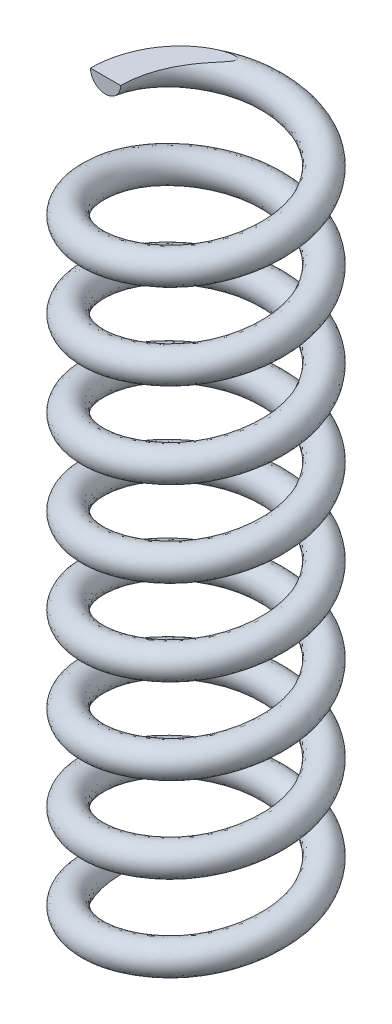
ISO-10303-21;
HEADER;
FILE_DESCRIPTION(('STEP AP214'),'2;1');
FILE_NAME('part.step','',(''),(''),'','','');
FILE_SCHEMA(('AUTOMOTIVE_DESIGN { 1 0 10303 214 1 1 1 1 }'));
ENDSEC;
DATA;
#1=APPLICATION_CONTEXT('core data for automotive mechanical design processes');
#2=APPLICATION_PROTOCOL_DEFINITION('international standard','automotive_design',2000,#1);
#3=PRODUCT_CONTEXT('',#1,'mechanical');
#4=PRODUCT('Part','Part','',(#3));
#5=PRODUCT_RELATED_PRODUCT_CATEGORY('part','',(#4));
#6=PRODUCT_DEFINITION_FORMATION('','',#4);
#7=PRODUCT_DEFINITION_CONTEXT('part definition',#1,'design');
#8=PRODUCT_DEFINITION('design','',#6,#7);
#9=PRODUCT_DEFINITION_SHAPE('','',#8);
#10=(LENGTH_UNIT() NAMED_UNIT(*) SI_UNIT(.MILLI.,.METRE.));
#11=(NAMED_UNIT(*) PLANE_ANGLE_UNIT() SI_UNIT($,.RADIAN.));
#12=(NAMED_UNIT(*) SI_UNIT($,.STERADIAN.) SOLID_ANGLE_UNIT());
#13=UNCERTAINTY_MEASURE_WITH_UNIT(LENGTH_MEASURE(1.E-05),#10,'distance_accuracy_value','');
#14=(GEOMETRIC_REPRESENTATION_CONTEXT(3) GLOBAL_UNCERTAINTY_ASSIGNED_CONTEXT((#13)) GLOBAL_UNIT_ASSIGNED_CONTEXT((#10,
#11,#12)) REPRESENTATION_CONTEXT('',''));
#15=CARTESIAN_POINT('',(0.,0.,0.));
#16=DIRECTION('',(0.,0.,1.));
#17=DIRECTION('',(1.,0.,0.));
#18=AXIS2_PLACEMENT_3D('',#15,#16,#17);
#19=CARTESIAN_POINT('',(-6.,34.6744733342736,0.));
#20=DIRECTION('',(0.,0.,1.));
#21=DIRECTION('',(1.,0.,0.));
#22=AXIS2_PLACEMENT_3D('',#19,#20,#21);
#23=PLANE('',#22);
#24=CARTESIAN_POINT('',(-6.,34.6744733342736,0.));
#25=DIRECTION('',(0.,0.,1.));
#26=DIRECTION('',(1.,0.,0.));
#27=AXIS2_PLACEMENT_3D('',#24,#25,#26);
#28=CIRCLE('',#27,1.);
#29=CARTESIAN_POINT('',(-5.,34.6744733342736,0.));
#30=VERTEX_POINT('',#29);
#31=CARTESIAN_POINT('',(-7.,34.6744733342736,0.));
#32=VERTEX_POINT('',#31);
#33=EDGE_CURVE('E63',#30,#32,#28,.T.);
#34=ORIENTED_EDGE('',*,*,#33,.F.);
#35=DIRECTION('',(-1.,0.,0.));
#36=VECTOR('',#35,1.);
#37=CARTESIAN_POINT('',(-6.,34.6744733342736,0.));
#38=LINE('',#37,#36);
#39=EDGE_CURVE('E71',#30,#32,#38,.T.);
#40=ORIENTED_EDGE('',*,*,#39,.T.);
#41=EDGE_LOOP('',(#34,#40));
#42=FACE_BOUND('',#41,.T.);
#43=ADVANCED_FACE('F35',(#42),#23,.F.);
#44=CARTESIAN_POINT('',(-6.,80.,6.70364417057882E-13));
#45=DIRECTION('',(1.1172740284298E-13,0.,1.));
#46=DIRECTION('',(1.,0.,-1.1172740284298E-13));
#47=AXIS2_PLACEMENT_3D('',#44,#45,#46);
#48=PLANE('',#47);
#49=DIRECTION('',(1.,0.,-1.1172740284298E-13));
#50=VECTOR('',#49,1.);
#51=CARTESIAN_POINT('',(-6.,80.,6.70364417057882E-13));
#52=LINE('',#51,#50);
#53=CARTESIAN_POINT('',(-7.,80.,6.714628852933E-13));
#54=VERTEX_POINT('',#53);
#55=CARTESIAN_POINT('',(-5.,80.,5.58637014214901E-13));
#56=VERTEX_POINT('',#55);
#57=EDGE_CURVE('E69',#54,#56,#52,.T.);
#58=ORIENTED_EDGE('',*,*,#57,.F.);
#59=CARTESIAN_POINT('',(-6.,80.,6.70364417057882E-13));
#60=DIRECTION('',(1.1172740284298E-13,0.,1.));
#61=DIRECTION('',(1.,0.,-1.1172740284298E-13));
#62=AXIS2_PLACEMENT_3D('',#59,#60,#61);
#63=CIRCLE('',#62,1.);
#64=EDGE_CURVE('E68',#54,#56,#63,.T.);
#65=ORIENTED_EDGE('',*,*,#64,.T.);
#66=EDGE_LOOP('',(#58,#65));
#67=FACE_BOUND('',#66,.T.);
#68=ADVANCED_FACE('F84',(#67),#48,.T.);
#69=CARTESIAN_POINT('',(-5.,34.6744733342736,0.));
#70=CARTESIAN_POINT('',(-5.,35.1466142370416,2.88675134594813));
#71=CARTESIAN_POINT('',(-2.5,35.6187551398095,4.33012701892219));
#72=CARTESIAN_POINT('',(0.,36.0908960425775,5.77350269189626));
#73=CARTESIAN_POINT('',(2.5,36.5630369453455,4.33012701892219));
#74=CARTESIAN_POINT('',(5.,37.0351778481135,2.88675134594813));
#75=CARTESIAN_POINT('',(5.,37.5073187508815,0.));
#76=CARTESIAN_POINT('',(5.,37.9794596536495,-2.88675134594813));
#77=CARTESIAN_POINT('',(2.5,38.4516005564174,-4.33012701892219));
#78=CARTESIAN_POINT('',(0.,38.9237414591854,-5.77350269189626));
#79=CARTESIAN_POINT('',(-2.5,39.3958823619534,-4.33012701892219));
#80=CARTESIAN_POINT('',(-5.,39.8680232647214,-2.88675134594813));
#81=CARTESIAN_POINT('',(-5.,40.3401641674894,0.));
#82=CARTESIAN_POINT('',(-5.,40.8123050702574,2.88675134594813));
#83=CARTESIAN_POINT('',(-2.5,41.2844459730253,4.33012701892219));
#84=CARTESIAN_POINT('',(0.,41.7565868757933,5.77350269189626));
#85=CARTESIAN_POINT('',(2.5,42.2287277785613,4.33012701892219));
#86=CARTESIAN_POINT('',(5.,42.7008686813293,2.88675134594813));
#87=CARTESIAN_POINT('',(5.,43.1730095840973,0.));
#88=CARTESIAN_POINT('',(5.,43.6451504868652,-2.88675134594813));
#89=CARTESIAN_POINT('',(2.5,44.1172913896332,-4.33012701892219));
#90=CARTESIAN_POINT('',(0.,44.5894322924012,-5.77350269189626));
#91=CARTESIAN_POINT('',(-2.5,45.0615731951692,-4.33012701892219));
#92=CARTESIAN_POINT('',(-5.,45.5337140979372,-2.88675134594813));
#93=CARTESIAN_POINT('',(-5.,46.0058550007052,0.));
#94=CARTESIAN_POINT('',(-5.,46.4779959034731,2.88675134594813));
#95=CARTESIAN_POINT('',(-2.5,46.9501368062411,4.33012701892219));
#96=CARTESIAN_POINT('',(0.,47.4222777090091,5.77350269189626));
#97=CARTESIAN_POINT('',(2.5,47.8944186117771,4.33012701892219));
#98=CARTESIAN_POINT('',(5.,48.3665595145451,2.88675134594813));
#99=CARTESIAN_POINT('',(5.,48.8387004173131,0.));
#100=CARTESIAN_POINT('',(5.,49.310841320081,-2.88675134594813));
#101=CARTESIAN_POINT('',(2.5,49.782982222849,-4.33012701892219));
#102=CARTESIAN_POINT('',(0.,50.255123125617,-5.77350269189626));
#103=CARTESIAN_POINT('',(-2.5,50.727264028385,-4.33012701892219));
#104=CARTESIAN_POINT('',(-5.,51.199404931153,-2.88675134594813));
#105=CARTESIAN_POINT('',(-5.,51.6715458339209,0.));
#106=CARTESIAN_POINT('',(-5.,52.1436867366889,2.88675134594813));
#107=CARTESIAN_POINT('',(-2.5,52.6158276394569,4.33012701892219));
#108=CARTESIAN_POINT('',(0.,53.0879685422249,5.77350269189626));
#109=CARTESIAN_POINT('',(2.5,53.5601094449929,4.33012701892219));
#110=CARTESIAN_POINT('',(5.,54.0322503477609,2.88675134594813));
#111=CARTESIAN_POINT('',(5.,54.5043912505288,0.));
#112=CARTESIAN_POINT('',(5.,54.9765321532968,-2.88675134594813));
#113=CARTESIAN_POINT('',(2.5,55.4486730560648,-4.33012701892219));
#114=CARTESIAN_POINT('',(0.,55.9208139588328,-5.77350269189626));
#115=CARTESIAN_POINT('',(-2.5,56.3929548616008,-4.33012701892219));
#116=CARTESIAN_POINT('',(-5.,56.8650957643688,-2.88675134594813));
#117=CARTESIAN_POINT('',(-5.,57.3372366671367,0.));
#118=CARTESIAN_POINT('',(-5.,57.8093775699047,2.88675134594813));
#119=CARTESIAN_POINT('',(-2.5,58.2815184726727,4.33012701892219));
#120=CARTESIAN_POINT('',(0.,58.7536593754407,5.77350269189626));
#121=CARTESIAN_POINT('',(2.5,59.2258002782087,4.33012701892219));
#122=CARTESIAN_POINT('',(5.,59.6979411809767,2.88675134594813));
#123=CARTESIAN_POINT('',(5.,60.1700820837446,0.));
#124=CARTESIAN_POINT('',(5.,60.6422229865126,-2.88675134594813));
#125=CARTESIAN_POINT('',(2.5,61.1143638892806,-4.33012701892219));
#126=CARTESIAN_POINT('',(0.,61.5865047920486,-5.77350269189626));
#127=CARTESIAN_POINT('',(-2.5,62.0586456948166,-4.33012701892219));
#128=CARTESIAN_POINT('',(-5.,62.5307865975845,-2.88675134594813));
#129=CARTESIAN_POINT('',(-5.,63.0029275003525,0.));
#130=CARTESIAN_POINT('',(-5.,63.4750684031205,2.88675134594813));
#131=CARTESIAN_POINT('',(-2.5,63.9472093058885,4.33012701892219));
#132=CARTESIAN_POINT('',(0.,64.4193502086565,5.77350269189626));
#133=CARTESIAN_POINT('',(2.5,64.8914911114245,4.33012701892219));
#134=CARTESIAN_POINT('',(5.,65.3636320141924,2.88675134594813));
#135=CARTESIAN_POINT('',(5.,65.8357729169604,0.));
#136=CARTESIAN_POINT('',(5.,66.3079138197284,-2.88675134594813));
#137=CARTESIAN_POINT('',(2.5,66.7800547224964,-4.33012701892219));
#138=CARTESIAN_POINT('',(0.,67.2521956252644,-5.77350269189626));
#139=CARTESIAN_POINT('',(-2.5,67.7243365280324,-4.33012701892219));
#140=CARTESIAN_POINT('',(-5.,68.1964774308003,-2.88675134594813));
#141=CARTESIAN_POINT('',(-5.,68.6686183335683,0.));
#142=CARTESIAN_POINT('',(-5.,69.1407592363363,2.88675134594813));
#143=CARTESIAN_POINT('',(-2.5,69.6129001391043,4.33012701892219));
#144=CARTESIAN_POINT('',(0.,70.0850410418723,5.77350269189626));
#145=CARTESIAN_POINT('',(2.5,70.5571819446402,4.33012701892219));
#146=CARTESIAN_POINT('',(5.,71.0293228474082,2.88675134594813));
#147=CARTESIAN_POINT('',(5.,71.5014637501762,0.));
#148=CARTESIAN_POINT('',(5.,71.9736046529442,-2.88675134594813));
#149=CARTESIAN_POINT('',(2.5,72.4457455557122,-4.33012701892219));
#150=CARTESIAN_POINT('',(0.,72.9178864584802,-5.77350269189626));
#151=CARTESIAN_POINT('',(-2.5,73.3900273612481,-4.33012701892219));
#152=CARTESIAN_POINT('',(-5.,73.8621682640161,-2.88675134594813));
#153=CARTESIAN_POINT('',(-5.,74.3343091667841,0.));
#154=CARTESIAN_POINT('',(-5.,74.8064500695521,2.88675134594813));
#155=CARTESIAN_POINT('',(-2.5,75.2785909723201,4.33012701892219));
#156=CARTESIAN_POINT('',(0.,75.7507318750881,5.77350269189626));
#157=CARTESIAN_POINT('',(2.5,76.222872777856,4.33012701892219));
#158=CARTESIAN_POINT('',(5.,76.695013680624,2.88675134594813));
#159=CARTESIAN_POINT('',(5.,77.167154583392,0.));
#160=CARTESIAN_POINT('',(5.,77.63929548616,-2.88675134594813));
#161=CARTESIAN_POINT('',(2.5,78.111436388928,-4.33012701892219));
#162=CARTESIAN_POINT('',(0.,78.583577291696,-5.77350269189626));
#163=CARTESIAN_POINT('',(-2.5,79.0557181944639,-4.33012701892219));
#164=CARTESIAN_POINT('',(-5.,79.5278590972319,-2.88675134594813));
#165=CARTESIAN_POINT('',(-5.,79.9999999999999,0.));
#166=CARTESIAN_POINT('',(-5.,80.4721409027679,2.88675134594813));
#167=CARTESIAN_POINT('',(-2.5,80.9442818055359,4.33012701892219));
#168=CARTESIAN_POINT('',(0.,81.4164227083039,5.77350269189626));
#169=CARTESIAN_POINT('',(2.5,81.8885636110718,4.33012701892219));
#170=CARTESIAN_POINT('',(5.,82.3607045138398,2.88675134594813));
#171=CARTESIAN_POINT('',(5.,82.8328454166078,0.));
#172=CARTESIAN_POINT('',(5.,83.3049863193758,-2.88675134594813));
#173=CARTESIAN_POINT('',(2.5,83.7771272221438,-4.33012701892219));
#174=CARTESIAN_POINT('',(0.,84.2492681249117,-5.77350269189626));
#175=CARTESIAN_POINT('',(-2.5,84.7214090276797,-4.33012701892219));
#176=CARTESIAN_POINT('',(-5.,85.1935499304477,-2.88675134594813));
#177=CARTESIAN_POINT('',(-5.,85.6656908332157,0.));
#178=CARTESIAN_POINT('',(-5.,36.6744733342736,0.));
#179=CARTESIAN_POINT('',(-5.,37.1466142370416,2.88675134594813));
#180=CARTESIAN_POINT('',(-2.5,37.6187551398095,4.33012701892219));
#181=CARTESIAN_POINT('',(0.,38.0908960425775,5.77350269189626));
#182=CARTESIAN_POINT('',(2.5,38.5630369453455,4.33012701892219));
#183=CARTESIAN_POINT('',(5.,39.0351778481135,2.88675134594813));
#184=CARTESIAN_POINT('',(5.,39.5073187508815,0.));
#185=CARTESIAN_POINT('',(5.,39.9794596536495,-2.88675134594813));
#186=CARTESIAN_POINT('',(2.5,40.4516005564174,-4.33012701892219));
#187=CARTESIAN_POINT('',(0.,40.9237414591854,-5.77350269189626));
#188=CARTESIAN_POINT('',(-2.5,41.3958823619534,-4.33012701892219));
#189=CARTESIAN_POINT('',(-5.,41.8680232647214,-2.88675134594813));
#190=CARTESIAN_POINT('',(-5.,42.3401641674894,0.));
#191=CARTESIAN_POINT('',(-5.,42.8123050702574,2.88675134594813));
#192=CARTESIAN_POINT('',(-2.5,43.2844459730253,4.33012701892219));
#193=CARTESIAN_POINT('',(0.,43.7565868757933,5.77350269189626));
#194=CARTESIAN_POINT('',(2.5,44.2287277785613,4.33012701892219));
#195=CARTESIAN_POINT('',(5.,44.7008686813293,2.88675134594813));
#196=CARTESIAN_POINT('',(5.,45.1730095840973,0.));
#197=CARTESIAN_POINT('',(5.,45.6451504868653,-2.88675134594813));
#198=CARTESIAN_POINT('',(2.5,46.1172913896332,-4.33012701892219));
#199=CARTESIAN_POINT('',(0.,46.5894322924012,-5.77350269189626));
#200=CARTESIAN_POINT('',(-2.5,47.0615731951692,-4.33012701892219));
#201=CARTESIAN_POINT('',(-5.,47.5337140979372,-2.88675134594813));
#202=CARTESIAN_POINT('',(-5.,48.0058550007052,0.));
#203=CARTESIAN_POINT('',(-5.,48.4779959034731,2.88675134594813));
#204=CARTESIAN_POINT('',(-2.5,48.9501368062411,4.33012701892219));
#205=CARTESIAN_POINT('',(0.,49.4222777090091,5.77350269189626));
#206=CARTESIAN_POINT('',(2.5,49.8944186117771,4.33012701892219));
#207=CARTESIAN_POINT('',(5.,50.3665595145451,2.88675134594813));
#208=CARTESIAN_POINT('',(5.,50.8387004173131,0.));
#209=CARTESIAN_POINT('',(5.,51.310841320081,-2.88675134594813));
#210=CARTESIAN_POINT('',(2.5,51.782982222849,-4.33012701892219));
#211=CARTESIAN_POINT('',(0.,52.255123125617,-5.77350269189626));
#212=CARTESIAN_POINT('',(-2.5,52.727264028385,-4.33012701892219));
#213=CARTESIAN_POINT('',(-5.,53.199404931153,-2.88675134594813));
#214=CARTESIAN_POINT('',(-5.,53.6715458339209,0.));
#215=CARTESIAN_POINT('',(-5.,54.1436867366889,2.88675134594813));
#216=CARTESIAN_POINT('',(-2.5,54.6158276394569,4.33012701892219));
#217=CARTESIAN_POINT('',(0.,55.0879685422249,5.77350269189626));
#218=CARTESIAN_POINT('',(2.5,55.5601094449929,4.33012701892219));
#219=CARTESIAN_POINT('',(5.,56.0322503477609,2.88675134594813));
#220=CARTESIAN_POINT('',(5.,56.5043912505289,0.));
#221=CARTESIAN_POINT('',(5.,56.9765321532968,-2.88675134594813));
#222=CARTESIAN_POINT('',(2.5,57.4486730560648,-4.33012701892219));
#223=CARTESIAN_POINT('',(0.,57.9208139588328,-5.77350269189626));
#224=CARTESIAN_POINT('',(-2.5,58.3929548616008,-4.33012701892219));
#225=CARTESIAN_POINT('',(-5.,58.8650957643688,-2.88675134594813));
#226=CARTESIAN_POINT('',(-5.,59.3372366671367,0.));
#227=CARTESIAN_POINT('',(-5.,59.8093775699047,2.88675134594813));
#228=CARTESIAN_POINT('',(-2.5,60.2815184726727,4.33012701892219));
#229=CARTESIAN_POINT('',(0.,60.7536593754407,5.77350269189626));
#230=CARTESIAN_POINT('',(2.5,61.2258002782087,4.33012701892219));
#231=CARTESIAN_POINT('',(5.,61.6979411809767,2.88675134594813));
#232=CARTESIAN_POINT('',(5.,62.1700820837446,0.));
#233=CARTESIAN_POINT('',(5.,62.6422229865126,-2.88675134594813));
#234=CARTESIAN_POINT('',(2.5,63.1143638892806,-4.33012701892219));
#235=CARTESIAN_POINT('',(0.,63.5865047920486,-5.77350269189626));
#236=CARTESIAN_POINT('',(-2.5,64.0586456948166,-4.33012701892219));
#237=CARTESIAN_POINT('',(-5.,64.5307865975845,-2.88675134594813));
#238=CARTESIAN_POINT('',(-5.,65.0029275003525,0.));
#239=CARTESIAN_POINT('',(-5.,65.4750684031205,2.88675134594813));
#240=CARTESIAN_POINT('',(-2.5,65.9472093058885,4.33012701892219));
#241=CARTESIAN_POINT('',(0.,66.4193502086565,5.77350269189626));
#242=CARTESIAN_POINT('',(2.5,66.8914911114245,4.33012701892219));
#243=CARTESIAN_POINT('',(5.,67.3636320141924,2.88675134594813));
#244=CARTESIAN_POINT('',(5.,67.8357729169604,0.));
#245=CARTESIAN_POINT('',(5.,68.3079138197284,-2.88675134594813));
#246=CARTESIAN_POINT('',(2.5,68.7800547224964,-4.33012701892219));
#247=CARTESIAN_POINT('',(0.,69.2521956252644,-5.77350269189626));
#248=CARTESIAN_POINT('',(-2.5,69.7243365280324,-4.33012701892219));
#249=CARTESIAN_POINT('',(-5.,70.1964774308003,-2.88675134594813));
#250=CARTESIAN_POINT('',(-5.,70.6686183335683,0.));
#251=CARTESIAN_POINT('',(-5.,71.1407592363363,2.88675134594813));
#252=CARTESIAN_POINT('',(-2.5,71.6129001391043,4.33012701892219));
#253=CARTESIAN_POINT('',(0.,72.0850410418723,5.77350269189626));
#254=CARTESIAN_POINT('',(2.5,72.5571819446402,4.33012701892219));
#255=CARTESIAN_POINT('',(5.,73.0293228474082,2.88675134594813));
#256=CARTESIAN_POINT('',(5.,73.5014637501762,0.));
#257=CARTESIAN_POINT('',(5.,73.9736046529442,-2.88675134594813));
#258=CARTESIAN_POINT('',(2.5,74.4457455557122,-4.33012701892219));
#259=CARTESIAN_POINT('',(0.,74.9178864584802,-5.77350269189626));
#260=CARTESIAN_POINT('',(-2.5,75.3900273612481,-4.33012701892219));
#261=CARTESIAN_POINT('',(-5.,75.8621682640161,-2.88675134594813));
#262=CARTESIAN_POINT('',(-5.,76.3343091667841,0.));
#263=CARTESIAN_POINT('',(-5.,76.8064500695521,2.88675134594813));
#264=CARTESIAN_POINT('',(-2.5,77.2785909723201,4.33012701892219));
#265=CARTESIAN_POINT('',(0.,77.7507318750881,5.77350269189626));
#266=CARTESIAN_POINT('',(2.5,78.222872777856,4.33012701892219));
#267=CARTESIAN_POINT('',(5.,78.695013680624,2.88675134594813));
#268=CARTESIAN_POINT('',(5.,79.167154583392,0.));
#269=CARTESIAN_POINT('',(5.,79.63929548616,-2.88675134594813));
#270=CARTESIAN_POINT('',(2.5,80.111436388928,-4.33012701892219));
#271=CARTESIAN_POINT('',(0.,80.583577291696,-5.77350269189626));
#272=CARTESIAN_POINT('',(-2.5,81.0557181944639,-4.33012701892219));
#273=CARTESIAN_POINT('',(-5.,81.5278590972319,-2.88675134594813));
#274=CARTESIAN_POINT('',(-5.,81.9999999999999,0.));
#275=CARTESIAN_POINT('',(-5.,82.4721409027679,2.88675134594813));
#276=CARTESIAN_POINT('',(-2.5,82.9442818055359,4.33012701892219));
#277=CARTESIAN_POINT('',(0.,83.4164227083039,5.77350269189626));
#278=CARTESIAN_POINT('',(2.5,83.8885636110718,4.33012701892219));
#279=CARTESIAN_POINT('',(5.,84.3607045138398,2.88675134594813));
#280=CARTESIAN_POINT('',(5.,84.8328454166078,0.));
#281=CARTESIAN_POINT('',(5.,85.3049863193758,-2.88675134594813));
#282=CARTESIAN_POINT('',(2.5,85.7771272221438,-4.33012701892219));
#283=CARTESIAN_POINT('',(0.,86.2492681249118,-5.77350269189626));
#284=CARTESIAN_POINT('',(-2.5,86.7214090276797,-4.33012701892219));
#285=CARTESIAN_POINT('',(-5.,87.1935499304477,-2.88675134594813));
#286=CARTESIAN_POINT('',(-5.,87.6656908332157,0.));
#287=CARTESIAN_POINT('',(-7.,36.6744733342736,0.));
#288=CARTESIAN_POINT('',(-7.,37.1466142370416,4.04145188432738));
#289=CARTESIAN_POINT('',(-3.5,37.6187551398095,6.06217782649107));
#290=CARTESIAN_POINT('',(0.,38.0908960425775,8.08290376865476));
#291=CARTESIAN_POINT('',(3.5,38.5630369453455,6.06217782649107));
#292=CARTESIAN_POINT('',(7.,39.0351778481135,4.04145188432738));
#293=CARTESIAN_POINT('',(7.,39.5073187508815,0.));
#294=CARTESIAN_POINT('',(7.,39.9794596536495,-4.04145188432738));
#295=CARTESIAN_POINT('',(3.5,40.4516005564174,-6.06217782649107));
#296=CARTESIAN_POINT('',(0.,40.9237414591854,-8.08290376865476));
#297=CARTESIAN_POINT('',(-3.5,41.3958823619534,-6.06217782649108));
#298=CARTESIAN_POINT('',(-7.,41.8680232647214,-4.04145188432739));
#299=CARTESIAN_POINT('',(-7.,42.3401641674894,0.));
#300=CARTESIAN_POINT('',(-7.,42.8123050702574,4.04145188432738));
#301=CARTESIAN_POINT('',(-3.5,43.2844459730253,6.06217782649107));
#302=CARTESIAN_POINT('',(0.,43.7565868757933,8.08290376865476));
#303=CARTESIAN_POINT('',(3.5,44.2287277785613,6.06217782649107));
#304=CARTESIAN_POINT('',(7.,44.7008686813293,4.04145188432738));
#305=CARTESIAN_POINT('',(7.,45.1730095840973,0.));
#306=CARTESIAN_POINT('',(7.,45.6451504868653,-4.04145188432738));
#307=CARTESIAN_POINT('',(3.5,46.1172913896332,-6.06217782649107));
#308=CARTESIAN_POINT('',(0.,46.5894322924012,-8.08290376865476));
#309=CARTESIAN_POINT('',(-3.5,47.0615731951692,-6.06217782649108));
#310=CARTESIAN_POINT('',(-7.,47.5337140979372,-4.04145188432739));
#311=CARTESIAN_POINT('',(-7.,48.0058550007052,0.));
#312=CARTESIAN_POINT('',(-7.,48.4779959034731,4.04145188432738));
#313=CARTESIAN_POINT('',(-3.5,48.9501368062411,6.06217782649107));
#314=CARTESIAN_POINT('',(0.,49.4222777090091,8.08290376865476));
#315=CARTESIAN_POINT('',(3.5,49.8944186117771,6.06217782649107));
#316=CARTESIAN_POINT('',(7.,50.3665595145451,4.04145188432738));
#317=CARTESIAN_POINT('',(7.,50.8387004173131,0.));
#318=CARTESIAN_POINT('',(7.,51.310841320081,-4.04145188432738));
#319=CARTESIAN_POINT('',(3.5,51.782982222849,-6.06217782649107));
#320=CARTESIAN_POINT('',(0.,52.255123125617,-8.08290376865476));
#321=CARTESIAN_POINT('',(-3.5,52.727264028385,-6.06217782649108));
#322=CARTESIAN_POINT('',(-7.,53.199404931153,-4.04145188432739));
#323=CARTESIAN_POINT('',(-7.,53.6715458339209,0.));
#324=CARTESIAN_POINT('',(-7.,54.1436867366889,4.04145188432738));
#325=CARTESIAN_POINT('',(-3.5,54.6158276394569,6.06217782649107));
#326=CARTESIAN_POINT('',(0.,55.0879685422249,8.08290376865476));
#327=CARTESIAN_POINT('',(3.5,55.5601094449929,6.06217782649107));
#328=CARTESIAN_POINT('',(7.,56.0322503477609,4.04145188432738));
#329=CARTESIAN_POINT('',(7.,56.5043912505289,0.));
#330=CARTESIAN_POINT('',(7.,56.9765321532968,-4.04145188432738));
#331=CARTESIAN_POINT('',(3.5,57.4486730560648,-6.06217782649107));
#332=CARTESIAN_POINT('',(0.,57.9208139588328,-8.08290376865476));
#333=CARTESIAN_POINT('',(-3.5,58.3929548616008,-6.06217782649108));
#334=CARTESIAN_POINT('',(-7.,58.8650957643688,-4.04145188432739));
#335=CARTESIAN_POINT('',(-7.,59.3372366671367,0.));
#336=CARTESIAN_POINT('',(-7.,59.8093775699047,4.04145188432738));
#337=CARTESIAN_POINT('',(-3.5,60.2815184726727,6.06217782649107));
#338=CARTESIAN_POINT('',(0.,60.7536593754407,8.08290376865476));
#339=CARTESIAN_POINT('',(3.5,61.2258002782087,6.06217782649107));
#340=CARTESIAN_POINT('',(7.,61.6979411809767,4.04145188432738));
#341=CARTESIAN_POINT('',(7.,62.1700820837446,0.));
#342=CARTESIAN_POINT('',(7.,62.6422229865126,-4.04145188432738));
#343=CARTESIAN_POINT('',(3.5,63.1143638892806,-6.06217782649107));
#344=CARTESIAN_POINT('',(0.,63.5865047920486,-8.08290376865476));
#345=CARTESIAN_POINT('',(-3.5,64.0586456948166,-6.06217782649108));
#346=CARTESIAN_POINT('',(-7.,64.5307865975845,-4.04145188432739));
#347=CARTESIAN_POINT('',(-7.,65.0029275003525,0.));
#348=CARTESIAN_POINT('',(-7.,65.4750684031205,4.04145188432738));
#349=CARTESIAN_POINT('',(-3.5,65.9472093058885,6.06217782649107));
#350=CARTESIAN_POINT('',(0.,66.4193502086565,8.08290376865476));
#351=CARTESIAN_POINT('',(3.5,66.8914911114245,6.06217782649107));
#352=CARTESIAN_POINT('',(7.,67.3636320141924,4.04145188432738));
#353=CARTESIAN_POINT('',(7.,67.8357729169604,0.));
#354=CARTESIAN_POINT('',(7.,68.3079138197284,-4.04145188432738));
#355=CARTESIAN_POINT('',(3.5,68.7800547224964,-6.06217782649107));
#356=CARTESIAN_POINT('',(0.,69.2521956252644,-8.08290376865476));
#357=CARTESIAN_POINT('',(-3.5,69.7243365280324,-6.06217782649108));
#358=CARTESIAN_POINT('',(-7.,70.1964774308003,-4.04145188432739));
#359=CARTESIAN_POINT('',(-7.,70.6686183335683,0.));
#360=CARTESIAN_POINT('',(-7.,71.1407592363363,4.04145188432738));
#361=CARTESIAN_POINT('',(-3.5,71.6129001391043,6.06217782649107));
#362=CARTESIAN_POINT('',(0.,72.0850410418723,8.08290376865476));
#363=CARTESIAN_POINT('',(3.5,72.5571819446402,6.06217782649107));
#364=CARTESIAN_POINT('',(7.,73.0293228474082,4.04145188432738));
#365=CARTESIAN_POINT('',(7.,73.5014637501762,0.));
#366=CARTESIAN_POINT('',(7.,73.9736046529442,-4.04145188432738));
#367=CARTESIAN_POINT('',(3.5,74.4457455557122,-6.06217782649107));
#368=CARTESIAN_POINT('',(0.,74.9178864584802,-8.08290376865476));
#369=CARTESIAN_POINT('',(-3.5,75.3900273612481,-6.06217782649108));
#370=CARTESIAN_POINT('',(-7.,75.8621682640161,-4.04145188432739));
#371=CARTESIAN_POINT('',(-7.,76.3343091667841,0.));
#372=CARTESIAN_POINT('',(-7.,76.8064500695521,4.04145188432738));
#373=CARTESIAN_POINT('',(-3.5,77.2785909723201,6.06217782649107));
#374=CARTESIAN_POINT('',(0.,77.7507318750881,8.08290376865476));
#375=CARTESIAN_POINT('',(3.5,78.222872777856,6.06217782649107));
#376=CARTESIAN_POINT('',(7.,78.695013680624,4.04145188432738));
#377=CARTESIAN_POINT('',(7.,79.167154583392,0.));
#378=CARTESIAN_POINT('',(7.,79.63929548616,-4.04145188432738));
#379=CARTESIAN_POINT('',(3.5,80.111436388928,-6.06217782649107));
#380=CARTESIAN_POINT('',(0.,80.583577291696,-8.08290376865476));
#381=CARTESIAN_POINT('',(-3.5,81.0557181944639,-6.06217782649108));
#382=CARTESIAN_POINT('',(-7.,81.5278590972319,-4.04145188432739));
#383=CARTESIAN_POINT('',(-7.,81.9999999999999,0.));
#384=CARTESIAN_POINT('',(-7.,82.4721409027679,4.04145188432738));
#385=CARTESIAN_POINT('',(-3.5,82.9442818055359,6.06217782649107));
#386=CARTESIAN_POINT('',(0.,83.4164227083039,8.08290376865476));
#387=CARTESIAN_POINT('',(3.5,83.8885636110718,6.06217782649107));
#388=CARTESIAN_POINT('',(7.,84.3607045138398,4.04145188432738));
#389=CARTESIAN_POINT('',(7.,84.8328454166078,0.));
#390=CARTESIAN_POINT('',(7.,85.3049863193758,-4.04145188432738));
#391=CARTESIAN_POINT('',(3.5,85.7771272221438,-6.06217782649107));
#392=CARTESIAN_POINT('',(0.,86.2492681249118,-8.08290376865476));
#393=CARTESIAN_POINT('',(-3.5,86.7214090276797,-6.06217782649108));
#394=CARTESIAN_POINT('',(-7.,87.1935499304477,-4.04145188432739));
#395=CARTESIAN_POINT('',(-7.,87.6656908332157,0.));
#396=CARTESIAN_POINT('',(-7.,34.6744733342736,0.));
#397=CARTESIAN_POINT('',(-7.,35.1466142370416,4.04145188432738));
#398=CARTESIAN_POINT('',(-3.5,35.6187551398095,6.06217782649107));
#399=CARTESIAN_POINT('',(0.,36.0908960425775,8.08290376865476));
#400=CARTESIAN_POINT('',(3.5,36.5630369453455,6.06217782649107));
#401=CARTESIAN_POINT('',(7.,37.0351778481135,4.04145188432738));
#402=CARTESIAN_POINT('',(7.,37.5073187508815,0.));
#403=CARTESIAN_POINT('',(7.,37.9794596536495,-4.04145188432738));
#404=CARTESIAN_POINT('',(3.5,38.4516005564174,-6.06217782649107));
#405=CARTESIAN_POINT('',(0.,38.9237414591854,-8.08290376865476));
#406=CARTESIAN_POINT('',(-3.5,39.3958823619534,-6.06217782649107));
#407=CARTESIAN_POINT('',(-7.,39.8680232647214,-4.04145188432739));
#408=CARTESIAN_POINT('',(-7.,40.3401641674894,0.));
#409=CARTESIAN_POINT('',(-7.,40.8123050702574,4.04145188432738));
#410=CARTESIAN_POINT('',(-3.5,41.2844459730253,6.06217782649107));
#411=CARTESIAN_POINT('',(0.,41.7565868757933,8.08290376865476));
#412=CARTESIAN_POINT('',(3.5,42.2287277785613,6.06217782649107));
#413=CARTESIAN_POINT('',(7.,42.7008686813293,4.04145188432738));
#414=CARTESIAN_POINT('',(7.,43.1730095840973,0.));
#415=CARTESIAN_POINT('',(7.,43.6451504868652,-4.04145188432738));
#416=CARTESIAN_POINT('',(3.5,44.1172913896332,-6.06217782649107));
#417=CARTESIAN_POINT('',(0.,44.5894322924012,-8.08290376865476));
#418=CARTESIAN_POINT('',(-3.5,45.0615731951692,-6.06217782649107));
#419=CARTESIAN_POINT('',(-7.,45.5337140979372,-4.04145188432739));
#420=CARTESIAN_POINT('',(-7.,46.0058550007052,0.));
#421=CARTESIAN_POINT('',(-7.,46.4779959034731,4.04145188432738));
#422=CARTESIAN_POINT('',(-3.5,46.9501368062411,6.06217782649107));
#423=CARTESIAN_POINT('',(0.,47.4222777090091,8.08290376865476));
#424=CARTESIAN_POINT('',(3.5,47.8944186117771,6.06217782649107));
#425=CARTESIAN_POINT('',(7.,48.3665595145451,4.04145188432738));
#426=CARTESIAN_POINT('',(7.,48.8387004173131,0.));
#427=CARTESIAN_POINT('',(7.,49.310841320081,-4.04145188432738));
#428=CARTESIAN_POINT('',(3.5,49.782982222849,-6.06217782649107));
#429=CARTESIAN_POINT('',(0.,50.255123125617,-8.08290376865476));
#430=CARTESIAN_POINT('',(-3.5,50.727264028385,-6.06217782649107));
#431=CARTESIAN_POINT('',(-7.,51.199404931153,-4.04145188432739));
#432=CARTESIAN_POINT('',(-7.,51.6715458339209,0.));
#433=CARTESIAN_POINT('',(-7.,52.1436867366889,4.04145188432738));
#434=CARTESIAN_POINT('',(-3.5,52.6158276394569,6.06217782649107));
#435=CARTESIAN_POINT('',(0.,53.0879685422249,8.08290376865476));
#436=CARTESIAN_POINT('',(3.5,53.5601094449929,6.06217782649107));
#437=CARTESIAN_POINT('',(7.,54.0322503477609,4.04145188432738));
#438=CARTESIAN_POINT('',(7.,54.5043912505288,0.));
#439=CARTESIAN_POINT('',(7.,54.9765321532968,-4.04145188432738));
#440=CARTESIAN_POINT('',(3.5,55.4486730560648,-6.06217782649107));
#441=CARTESIAN_POINT('',(0.,55.9208139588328,-8.08290376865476));
#442=CARTESIAN_POINT('',(-3.5,56.3929548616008,-6.06217782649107));
#443=CARTESIAN_POINT('',(-7.,56.8650957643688,-4.04145188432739));
#444=CARTESIAN_POINT('',(-7.,57.3372366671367,0.));
#445=CARTESIAN_POINT('',(-7.,57.8093775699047,4.04145188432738));
#446=CARTESIAN_POINT('',(-3.5,58.2815184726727,6.06217782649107));
#447=CARTESIAN_POINT('',(0.,58.7536593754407,8.08290376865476));
#448=CARTESIAN_POINT('',(3.5,59.2258002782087,6.06217782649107));
#449=CARTESIAN_POINT('',(7.,59.6979411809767,4.04145188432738));
#450=CARTESIAN_POINT('',(7.,60.1700820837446,0.));
#451=CARTESIAN_POINT('',(7.,60.6422229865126,-4.04145188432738));
#452=CARTESIAN_POINT('',(3.5,61.1143638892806,-6.06217782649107));
#453=CARTESIAN_POINT('',(0.,61.5865047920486,-8.08290376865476));
#454=CARTESIAN_POINT('',(-3.5,62.0586456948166,-6.06217782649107));
#455=CARTESIAN_POINT('',(-7.,62.5307865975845,-4.04145188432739));
#456=CARTESIAN_POINT('',(-7.,63.0029275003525,0.));
#457=CARTESIAN_POINT('',(-7.,63.4750684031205,4.04145188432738));
#458=CARTESIAN_POINT('',(-3.5,63.9472093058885,6.06217782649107));
#459=CARTESIAN_POINT('',(0.,64.4193502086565,8.08290376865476));
#460=CARTESIAN_POINT('',(3.5,64.8914911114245,6.06217782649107));
#461=CARTESIAN_POINT('',(7.,65.3636320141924,4.04145188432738));
#462=CARTESIAN_POINT('',(7.,65.8357729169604,0.));
#463=CARTESIAN_POINT('',(7.,66.3079138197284,-4.04145188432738));
#464=CARTESIAN_POINT('',(3.5,66.7800547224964,-6.06217782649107));
#465=CARTESIAN_POINT('',(0.,67.2521956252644,-8.08290376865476));
#466=CARTESIAN_POINT('',(-3.5,67.7243365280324,-6.06217782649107));
#467=CARTESIAN_POINT('',(-7.,68.1964774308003,-4.04145188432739));
#468=CARTESIAN_POINT('',(-7.,68.6686183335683,0.));
#469=CARTESIAN_POINT('',(-7.,69.1407592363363,4.04145188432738));
#470=CARTESIAN_POINT('',(-3.5,69.6129001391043,6.06217782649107));
#471=CARTESIAN_POINT('',(0.,70.0850410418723,8.08290376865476));
#472=CARTESIAN_POINT('',(3.5,70.5571819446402,6.06217782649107));
#473=CARTESIAN_POINT('',(7.,71.0293228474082,4.04145188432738));
#474=CARTESIAN_POINT('',(7.,71.5014637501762,0.));
#475=CARTESIAN_POINT('',(7.,71.9736046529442,-4.04145188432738));
#476=CARTESIAN_POINT('',(3.5,72.4457455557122,-6.06217782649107));
#477=CARTESIAN_POINT('',(0.,72.9178864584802,-8.08290376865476));
#478=CARTESIAN_POINT('',(-3.5,73.3900273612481,-6.06217782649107));
#479=CARTESIAN_POINT('',(-7.,73.8621682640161,-4.04145188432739));
#480=CARTESIAN_POINT('',(-7.,74.3343091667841,0.));
#481=CARTESIAN_POINT('',(-7.,74.8064500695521,4.04145188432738));
#482=CARTESIAN_POINT('',(-3.5,75.2785909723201,6.06217782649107));
#483=CARTESIAN_POINT('',(0.,75.7507318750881,8.08290376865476));
#484=CARTESIAN_POINT('',(3.5,76.222872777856,6.06217782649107));
#485=CARTESIAN_POINT('',(7.,76.695013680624,4.04145188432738));
#486=CARTESIAN_POINT('',(7.,77.167154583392,0.));
#487=CARTESIAN_POINT('',(7.,77.63929548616,-4.04145188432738));
#488=CARTESIAN_POINT('',(3.5,78.111436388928,-6.06217782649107));
#489=CARTESIAN_POINT('',(0.,78.583577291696,-8.08290376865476));
#490=CARTESIAN_POINT('',(-3.5,79.0557181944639,-6.06217782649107));
#491=CARTESIAN_POINT('',(-7.,79.5278590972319,-4.04145188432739));
#492=CARTESIAN_POINT('',(-7.,79.9999999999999,0.));
#493=CARTESIAN_POINT('',(-7.,80.4721409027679,4.04145188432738));
#494=CARTESIAN_POINT('',(-3.5,80.9442818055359,6.06217782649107));
#495=CARTESIAN_POINT('',(0.,81.4164227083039,8.08290376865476));
#496=CARTESIAN_POINT('',(3.5,81.8885636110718,6.06217782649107));
#497=CARTESIAN_POINT('',(7.,82.3607045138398,4.04145188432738));
#498=CARTESIAN_POINT('',(7.,82.8328454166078,0.));
#499=CARTESIAN_POINT('',(7.,83.3049863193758,-4.04145188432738));
#500=CARTESIAN_POINT('',(3.5,83.7771272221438,-6.06217782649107));
#501=CARTESIAN_POINT('',(0.,84.2492681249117,-8.08290376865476));
#502=CARTESIAN_POINT('',(-3.5,84.7214090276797,-6.06217782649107));
#503=CARTESIAN_POINT('',(-7.,85.1935499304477,-4.04145188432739));
#504=CARTESIAN_POINT('',(-7.,85.6656908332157,0.));
#505=CARTESIAN_POINT('',(-7.,32.6744733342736,0.));
#506=CARTESIAN_POINT('',(-7.,33.1466142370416,4.04145188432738));
#507=CARTESIAN_POINT('',(-3.5,33.6187551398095,6.06217782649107));
#508=CARTESIAN_POINT('',(0.,34.0908960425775,8.08290376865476));
#509=CARTESIAN_POINT('',(3.5,34.5630369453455,6.06217782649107));
#510=CARTESIAN_POINT('',(7.,35.0351778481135,4.04145188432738));
#511=CARTESIAN_POINT('',(7.,35.5073187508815,0.));
#512=CARTESIAN_POINT('',(7.,35.9794596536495,-4.04145188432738));
#513=CARTESIAN_POINT('',(3.5,36.4516005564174,-6.06217782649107));
#514=CARTESIAN_POINT('',(0.,36.9237414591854,-8.08290376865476));
#515=CARTESIAN_POINT('',(-3.5,37.3958823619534,-6.06217782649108));
#516=CARTESIAN_POINT('',(-7.,37.8680232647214,-4.04145188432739));
#517=CARTESIAN_POINT('',(-7.,38.3401641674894,0.));
#518=CARTESIAN_POINT('',(-7.,38.8123050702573,4.04145188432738));
#519=CARTESIAN_POINT('',(-3.5,39.2844459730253,6.06217782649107));
#520=CARTESIAN_POINT('',(0.,39.7565868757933,8.08290376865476));
#521=CARTESIAN_POINT('',(3.5,40.2287277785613,6.06217782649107));
#522=CARTESIAN_POINT('',(7.,40.7008686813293,4.04145188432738));
#523=CARTESIAN_POINT('',(7.,41.1730095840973,0.));
#524=CARTESIAN_POINT('',(7.,41.6451504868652,-4.04145188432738));
#525=CARTESIAN_POINT('',(3.5,42.1172913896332,-6.06217782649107));
#526=CARTESIAN_POINT('',(0.,42.5894322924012,-8.08290376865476));
#527=CARTESIAN_POINT('',(-3.5,43.0615731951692,-6.06217782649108));
#528=CARTESIAN_POINT('',(-7.,43.5337140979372,-4.04145188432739));
#529=CARTESIAN_POINT('',(-7.,44.0058550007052,0.));
#530=CARTESIAN_POINT('',(-7.,44.4779959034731,4.04145188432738));
#531=CARTESIAN_POINT('',(-3.5,44.9501368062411,6.06217782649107));
#532=CARTESIAN_POINT('',(0.,45.4222777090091,8.08290376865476));
#533=CARTESIAN_POINT('',(3.5,45.8944186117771,6.06217782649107));
#534=CARTESIAN_POINT('',(7.,46.3665595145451,4.04145188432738));
#535=CARTESIAN_POINT('',(7.,46.8387004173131,0.));
#536=CARTESIAN_POINT('',(7.,47.310841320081,-4.04145188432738));
#537=CARTESIAN_POINT('',(3.5,47.782982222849,-6.06217782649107));
#538=CARTESIAN_POINT('',(0.,48.255123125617,-8.08290376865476));
#539=CARTESIAN_POINT('',(-3.5,48.727264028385,-6.06217782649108));
#540=CARTESIAN_POINT('',(-7.,49.199404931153,-4.04145188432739));
#541=CARTESIAN_POINT('',(-7.,49.671545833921,0.));
#542=CARTESIAN_POINT('',(-7.,50.1436867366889,4.04145188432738));
#543=CARTESIAN_POINT('',(-3.5,50.6158276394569,6.06217782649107));
#544=CARTESIAN_POINT('',(0.,51.0879685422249,8.08290376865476));
#545=CARTESIAN_POINT('',(3.5,51.5601094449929,6.06217782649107));
#546=CARTESIAN_POINT('',(7.,52.0322503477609,4.04145188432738));
#547=CARTESIAN_POINT('',(7.,52.5043912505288,0.));
#548=CARTESIAN_POINT('',(7.,52.9765321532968,-4.04145188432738));
#549=CARTESIAN_POINT('',(3.5,53.4486730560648,-6.06217782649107));
#550=CARTESIAN_POINT('',(0.,53.9208139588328,-8.08290376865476));
#551=CARTESIAN_POINT('',(-3.5,54.3929548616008,-6.06217782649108));
#552=CARTESIAN_POINT('',(-7.,54.8650957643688,-4.04145188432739));
#553=CARTESIAN_POINT('',(-7.,55.3372366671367,0.));
#554=CARTESIAN_POINT('',(-7.,55.8093775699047,4.04145188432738));
#555=CARTESIAN_POINT('',(-3.5,56.2815184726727,6.06217782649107));
#556=CARTESIAN_POINT('',(0.,56.7536593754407,8.08290376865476));
#557=CARTESIAN_POINT('',(3.5,57.2258002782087,6.06217782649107));
#558=CARTESIAN_POINT('',(7.,57.6979411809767,4.04145188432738));
#559=CARTESIAN_POINT('',(7.,58.1700820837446,0.));
#560=CARTESIAN_POINT('',(7.,58.6422229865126,-4.04145188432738));
#561=CARTESIAN_POINT('',(3.5,59.1143638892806,-6.06217782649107));
#562=CARTESIAN_POINT('',(0.,59.5865047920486,-8.08290376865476));
#563=CARTESIAN_POINT('',(-3.5,60.0586456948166,-6.06217782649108));
#564=CARTESIAN_POINT('',(-7.,60.5307865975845,-4.04145188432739));
#565=CARTESIAN_POINT('',(-7.,61.0029275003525,0.));
#566=CARTESIAN_POINT('',(-7.,61.4750684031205,4.04145188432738));
#567=CARTESIAN_POINT('',(-3.5,61.9472093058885,6.06217782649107));
#568=CARTESIAN_POINT('',(0.,62.4193502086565,8.08290376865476));
#569=CARTESIAN_POINT('',(3.5,62.8914911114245,6.06217782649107));
#570=CARTESIAN_POINT('',(7.,63.3636320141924,4.04145188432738));
#571=CARTESIAN_POINT('',(7.,63.8357729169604,0.));
#572=CARTESIAN_POINT('',(7.,64.3079138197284,-4.04145188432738));
#573=CARTESIAN_POINT('',(3.5,64.7800547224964,-6.06217782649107));
#574=CARTESIAN_POINT('',(0.,65.2521956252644,-8.08290376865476));
#575=CARTESIAN_POINT('',(-3.5,65.7243365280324,-6.06217782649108));
#576=CARTESIAN_POINT('',(-7.,66.1964774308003,-4.04145188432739));
#577=CARTESIAN_POINT('',(-7.,66.6686183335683,0.));
#578=CARTESIAN_POINT('',(-7.,67.1407592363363,4.04145188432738));
#579=CARTESIAN_POINT('',(-3.5,67.6129001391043,6.06217782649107));
#580=CARTESIAN_POINT('',(0.,68.0850410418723,8.08290376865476));
#581=CARTESIAN_POINT('',(3.5,68.5571819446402,6.06217782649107));
#582=CARTESIAN_POINT('',(7.,69.0293228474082,4.04145188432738));
#583=CARTESIAN_POINT('',(7.,69.5014637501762,0.));
#584=CARTESIAN_POINT('',(7.,69.9736046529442,-4.04145188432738));
#585=CARTESIAN_POINT('',(3.5,70.4457455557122,-6.06217782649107));
#586=CARTESIAN_POINT('',(0.,70.9178864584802,-8.08290376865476));
#587=CARTESIAN_POINT('',(-3.5,71.3900273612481,-6.06217782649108));
#588=CARTESIAN_POINT('',(-7.,71.8621682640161,-4.04145188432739));
#589=CARTESIAN_POINT('',(-7.,72.3343091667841,0.));
#590=CARTESIAN_POINT('',(-7.,72.8064500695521,4.04145188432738));
#591=CARTESIAN_POINT('',(-3.5,73.2785909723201,6.06217782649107));
#592=CARTESIAN_POINT('',(0.,73.7507318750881,8.08290376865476));
#593=CARTESIAN_POINT('',(3.5,74.222872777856,6.06217782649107));
#594=CARTESIAN_POINT('',(7.,74.695013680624,4.04145188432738));
#595=CARTESIAN_POINT('',(7.,75.167154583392,0.));
#596=CARTESIAN_POINT('',(7.,75.63929548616,-4.04145188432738));
#597=CARTESIAN_POINT('',(3.5,76.111436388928,-6.06217782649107));
#598=CARTESIAN_POINT('',(0.,76.583577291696,-8.08290376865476));
#599=CARTESIAN_POINT('',(-3.5,77.0557181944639,-6.06217782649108));
#600=CARTESIAN_POINT('',(-7.,77.5278590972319,-4.04145188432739));
#601=CARTESIAN_POINT('',(-7.,77.9999999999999,0.));
#602=CARTESIAN_POINT('',(-7.,78.4721409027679,4.04145188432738));
#603=CARTESIAN_POINT('',(-3.5,78.9442818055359,6.06217782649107));
#604=CARTESIAN_POINT('',(0.,79.4164227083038,8.08290376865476));
#605=CARTESIAN_POINT('',(3.5,79.8885636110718,6.06217782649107));
#606=CARTESIAN_POINT('',(7.,80.3607045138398,4.04145188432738));
#607=CARTESIAN_POINT('',(7.,80.8328454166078,0.));
#608=CARTESIAN_POINT('',(7.,81.3049863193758,-4.04145188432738));
#609=CARTESIAN_POINT('',(3.5,81.7771272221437,-6.06217782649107));
#610=CARTESIAN_POINT('',(0.,82.2492681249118,-8.08290376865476));
#611=CARTESIAN_POINT('',(-3.5,82.7214090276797,-6.06217782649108));
#612=CARTESIAN_POINT('',(-7.,83.1935499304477,-4.04145188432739));
#613=CARTESIAN_POINT('',(-7.,83.6656908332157,0.));
#614=CARTESIAN_POINT('',(-5.,32.6744733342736,0.));
#615=CARTESIAN_POINT('',(-5.,33.1466142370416,2.88675134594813));
#616=CARTESIAN_POINT('',(-2.5,33.6187551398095,4.33012701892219));
#617=CARTESIAN_POINT('',(0.,34.0908960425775,5.77350269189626));
#618=CARTESIAN_POINT('',(2.5,34.5630369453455,4.33012701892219));
#619=CARTESIAN_POINT('',(5.,35.0351778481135,2.88675134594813));
#620=CARTESIAN_POINT('',(5.,35.5073187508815,0.));
#621=CARTESIAN_POINT('',(5.,35.9794596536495,-2.88675134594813));
#622=CARTESIAN_POINT('',(2.5,36.4516005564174,-4.33012701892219));
#623=CARTESIAN_POINT('',(0.,36.9237414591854,-5.77350269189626));
#624=CARTESIAN_POINT('',(-2.5,37.3958823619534,-4.33012701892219));
#625=CARTESIAN_POINT('',(-5.,37.8680232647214,-2.88675134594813));
#626=CARTESIAN_POINT('',(-5.,38.3401641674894,0.));
#627=CARTESIAN_POINT('',(-5.,38.8123050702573,2.88675134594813));
#628=CARTESIAN_POINT('',(-2.5,39.2844459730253,4.33012701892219));
#629=CARTESIAN_POINT('',(0.,39.7565868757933,5.77350269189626));
#630=CARTESIAN_POINT('',(2.5,40.2287277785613,4.33012701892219));
#631=CARTESIAN_POINT('',(5.,40.7008686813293,2.88675134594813));
#632=CARTESIAN_POINT('',(5.,41.1730095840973,0.));
#633=CARTESIAN_POINT('',(5.,41.6451504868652,-2.88675134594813));
#634=CARTESIAN_POINT('',(2.5,42.1172913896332,-4.33012701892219));
#635=CARTESIAN_POINT('',(0.,42.5894322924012,-5.77350269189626));
#636=CARTESIAN_POINT('',(-2.5,43.0615731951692,-4.33012701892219));
#637=CARTESIAN_POINT('',(-5.,43.5337140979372,-2.88675134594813));
#638=CARTESIAN_POINT('',(-5.,44.0058550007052,0.));
#639=CARTESIAN_POINT('',(-5.,44.4779959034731,2.88675134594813));
#640=CARTESIAN_POINT('',(-2.5,44.9501368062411,4.33012701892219));
#641=CARTESIAN_POINT('',(0.,45.4222777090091,5.77350269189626));
#642=CARTESIAN_POINT('',(2.5,45.8944186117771,4.33012701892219));
#643=CARTESIAN_POINT('',(5.,46.3665595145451,2.88675134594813));
#644=CARTESIAN_POINT('',(5.,46.8387004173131,0.));
#645=CARTESIAN_POINT('',(5.,47.310841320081,-2.88675134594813));
#646=CARTESIAN_POINT('',(2.5,47.782982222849,-4.33012701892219));
#647=CARTESIAN_POINT('',(0.,48.255123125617,-5.77350269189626));
#648=CARTESIAN_POINT('',(-2.5,48.727264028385,-4.33012701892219));
#649=CARTESIAN_POINT('',(-5.,49.199404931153,-2.88675134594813));
#650=CARTESIAN_POINT('',(-5.,49.671545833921,0.));
#651=CARTESIAN_POINT('',(-5.,50.1436867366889,2.88675134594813));
#652=CARTESIAN_POINT('',(-2.5,50.6158276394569,4.33012701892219));
#653=CARTESIAN_POINT('',(0.,51.0879685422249,5.77350269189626));
#654=CARTESIAN_POINT('',(2.5,51.5601094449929,4.33012701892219));
#655=CARTESIAN_POINT('',(5.,52.0322503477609,2.88675134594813));
#656=CARTESIAN_POINT('',(5.,52.5043912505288,0.));
#657=CARTESIAN_POINT('',(5.,52.9765321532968,-2.88675134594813));
#658=CARTESIAN_POINT('',(2.5,53.4486730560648,-4.33012701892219));
#659=CARTESIAN_POINT('',(0.,53.9208139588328,-5.77350269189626));
#660=CARTESIAN_POINT('',(-2.5,54.3929548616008,-4.33012701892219));
#661=CARTESIAN_POINT('',(-5.,54.8650957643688,-2.88675134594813));
#662=CARTESIAN_POINT('',(-5.,55.3372366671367,0.));
#663=CARTESIAN_POINT('',(-5.,55.8093775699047,2.88675134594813));
#664=CARTESIAN_POINT('',(-2.5,56.2815184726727,4.33012701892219));
#665=CARTESIAN_POINT('',(0.,56.7536593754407,5.77350269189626));
#666=CARTESIAN_POINT('',(2.5,57.2258002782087,4.33012701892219));
#667=CARTESIAN_POINT('',(5.,57.6979411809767,2.88675134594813));
#668=CARTESIAN_POINT('',(5.,58.1700820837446,0.));
#669=CARTESIAN_POINT('',(5.,58.6422229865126,-2.88675134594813));
#670=CARTESIAN_POINT('',(2.5,59.1143638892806,-4.33012701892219));
#671=CARTESIAN_POINT('',(0.,59.5865047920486,-5.77350269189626));
#672=CARTESIAN_POINT('',(-2.5,60.0586456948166,-4.33012701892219));
#673=CARTESIAN_POINT('',(-5.,60.5307865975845,-2.88675134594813));
#674=CARTESIAN_POINT('',(-5.,61.0029275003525,0.));
#675=CARTESIAN_POINT('',(-5.,61.4750684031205,2.88675134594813));
#676=CARTESIAN_POINT('',(-2.5,61.9472093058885,4.33012701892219));
#677=CARTESIAN_POINT('',(0.,62.4193502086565,5.77350269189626));
#678=CARTESIAN_POINT('',(2.5,62.8914911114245,4.33012701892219));
#679=CARTESIAN_POINT('',(5.,63.3636320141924,2.88675134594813));
#680=CARTESIAN_POINT('',(5.,63.8357729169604,0.));
#681=CARTESIAN_POINT('',(5.,64.3079138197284,-2.88675134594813));
#682=CARTESIAN_POINT('',(2.5,64.7800547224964,-4.33012701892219));
#683=CARTESIAN_POINT('',(0.,65.2521956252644,-5.77350269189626));
#684=CARTESIAN_POINT('',(-2.5,65.7243365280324,-4.33012701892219));
#685=CARTESIAN_POINT('',(-5.,66.1964774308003,-2.88675134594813));
#686=CARTESIAN_POINT('',(-5.,66.6686183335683,0.));
#687=CARTESIAN_POINT('',(-5.,67.1407592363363,2.88675134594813));
#688=CARTESIAN_POINT('',(-2.5,67.6129001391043,4.33012701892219));
#689=CARTESIAN_POINT('',(0.,68.0850410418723,5.77350269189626));
#690=CARTESIAN_POINT('',(2.5,68.5571819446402,4.33012701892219));
#691=CARTESIAN_POINT('',(5.,69.0293228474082,2.88675134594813));
#692=CARTESIAN_POINT('',(5.,69.5014637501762,0.));
#693=CARTESIAN_POINT('',(5.,69.9736046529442,-2.88675134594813));
#694=CARTESIAN_POINT('',(2.5,70.4457455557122,-4.33012701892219));
#695=CARTESIAN_POINT('',(0.,70.9178864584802,-5.77350269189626));
#696=CARTESIAN_POINT('',(-2.5,71.3900273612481,-4.33012701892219));
#697=CARTESIAN_POINT('',(-5.,71.8621682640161,-2.88675134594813));
#698=CARTESIAN_POINT('',(-5.,72.3343091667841,0.));
#699=CARTESIAN_POINT('',(-5.,72.8064500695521,2.88675134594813));
#700=CARTESIAN_POINT('',(-2.5,73.2785909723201,4.33012701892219));
#701=CARTESIAN_POINT('',(0.,73.7507318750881,5.77350269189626));
#702=CARTESIAN_POINT('',(2.5,74.222872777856,4.33012701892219));
#703=CARTESIAN_POINT('',(5.,74.695013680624,2.88675134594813));
#704=CARTESIAN_POINT('',(5.,75.167154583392,0.));
#705=CARTESIAN_POINT('',(5.,75.63929548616,-2.88675134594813));
#706=CARTESIAN_POINT('',(2.5,76.111436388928,-4.33012701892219));
#707=CARTESIAN_POINT('',(0.,76.583577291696,-5.77350269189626));
#708=CARTESIAN_POINT('',(-2.5,77.0557181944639,-4.33012701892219));
#709=CARTESIAN_POINT('',(-5.,77.5278590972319,-2.88675134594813));
#710=CARTESIAN_POINT('',(-5.,77.9999999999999,0.));
#711=CARTESIAN_POINT('',(-5.,78.4721409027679,2.88675134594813));
#712=CARTESIAN_POINT('',(-2.5,78.9442818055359,4.33012701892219));
#713=CARTESIAN_POINT('',(0.,79.4164227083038,5.77350269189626));
#714=CARTESIAN_POINT('',(2.5,79.8885636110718,4.33012701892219));
#715=CARTESIAN_POINT('',(5.,80.3607045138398,2.88675134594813));
#716=CARTESIAN_POINT('',(5.,80.8328454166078,0.));
#717=CARTESIAN_POINT('',(5.,81.3049863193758,-2.88675134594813));
#718=CARTESIAN_POINT('',(2.5,81.7771272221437,-4.33012701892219));
#719=CARTESIAN_POINT('',(0.,82.2492681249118,-5.77350269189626));
#720=CARTESIAN_POINT('',(-2.5,82.7214090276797,-4.33012701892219));
#721=CARTESIAN_POINT('',(-5.,83.1935499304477,-2.88675134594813));
#722=CARTESIAN_POINT('',(-5.,83.6656908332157,0.));
#723=CARTESIAN_POINT('',(-5.,34.6744733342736,0.));
#724=CARTESIAN_POINT('',(-5.,35.1466142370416,2.88675134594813));
#725=CARTESIAN_POINT('',(-2.5,35.6187551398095,4.33012701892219));
#726=CARTESIAN_POINT('',(0.,36.0908960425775,5.77350269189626));
#727=CARTESIAN_POINT('',(2.5,36.5630369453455,4.33012701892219));
#728=CARTESIAN_POINT('',(5.,37.0351778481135,2.88675134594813));
#729=CARTESIAN_POINT('',(5.,37.5073187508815,0.));
#730=CARTESIAN_POINT('',(5.,37.9794596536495,-2.88675134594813));
#731=CARTESIAN_POINT('',(2.5,38.4516005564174,-4.33012701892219));
#732=CARTESIAN_POINT('',(0.,38.9237414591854,-5.77350269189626));
#733=CARTESIAN_POINT('',(-2.5,39.3958823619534,-4.33012701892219));
#734=CARTESIAN_POINT('',(-5.,39.8680232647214,-2.88675134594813));
#735=CARTESIAN_POINT('',(-5.,40.3401641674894,0.));
#736=CARTESIAN_POINT('',(-5.,40.8123050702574,2.88675134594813));
#737=CARTESIAN_POINT('',(-2.5,41.2844459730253,4.33012701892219));
#738=CARTESIAN_POINT('',(0.,41.7565868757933,5.77350269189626));
#739=CARTESIAN_POINT('',(2.5,42.2287277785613,4.33012701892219));
#740=CARTESIAN_POINT('',(5.,42.7008686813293,2.88675134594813));
#741=CARTESIAN_POINT('',(5.,43.1730095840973,0.));
#742=CARTESIAN_POINT('',(5.,43.6451504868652,-2.88675134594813));
#743=CARTESIAN_POINT('',(2.5,44.1172913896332,-4.33012701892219));
#744=CARTESIAN_POINT('',(0.,44.5894322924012,-5.77350269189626));
#745=CARTESIAN_POINT('',(-2.5,45.0615731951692,-4.33012701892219));
#746=CARTESIAN_POINT('',(-5.,45.5337140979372,-2.88675134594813));
#747=CARTESIAN_POINT('',(-5.,46.0058550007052,0.));
#748=CARTESIAN_POINT('',(-5.,46.4779959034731,2.88675134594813));
#749=CARTESIAN_POINT('',(-2.5,46.9501368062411,4.33012701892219));
#750=CARTESIAN_POINT('',(0.,47.4222777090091,5.77350269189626));
#751=CARTESIAN_POINT('',(2.5,47.8944186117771,4.33012701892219));
#752=CARTESIAN_POINT('',(5.,48.3665595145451,2.88675134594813));
#753=CARTESIAN_POINT('',(5.,48.8387004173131,0.));
#754=CARTESIAN_POINT('',(5.,49.310841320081,-2.88675134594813));
#755=CARTESIAN_POINT('',(2.5,49.782982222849,-4.33012701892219));
#756=CARTESIAN_POINT('',(0.,50.255123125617,-5.77350269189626));
#757=CARTESIAN_POINT('',(-2.5,50.727264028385,-4.33012701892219));
#758=CARTESIAN_POINT('',(-5.,51.199404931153,-2.88675134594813));
#759=CARTESIAN_POINT('',(-5.,51.6715458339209,0.));
#760=CARTESIAN_POINT('',(-5.,52.1436867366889,2.88675134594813));
#761=CARTESIAN_POINT('',(-2.5,52.6158276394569,4.33012701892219));
#762=CARTESIAN_POINT('',(0.,53.0879685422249,5.77350269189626));
#763=CARTESIAN_POINT('',(2.5,53.5601094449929,4.33012701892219));
#764=CARTESIAN_POINT('',(5.,54.0322503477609,2.88675134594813));
#765=CARTESIAN_POINT('',(5.,54.5043912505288,0.));
#766=CARTESIAN_POINT('',(5.,54.9765321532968,-2.88675134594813));
#767=CARTESIAN_POINT('',(2.5,55.4486730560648,-4.33012701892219));
#768=CARTESIAN_POINT('',(0.,55.9208139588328,-5.77350269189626));
#769=CARTESIAN_POINT('',(-2.5,56.3929548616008,-4.33012701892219));
#770=CARTESIAN_POINT('',(-5.,56.8650957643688,-2.88675134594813));
#771=CARTESIAN_POINT('',(-5.,57.3372366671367,0.));
#772=CARTESIAN_POINT('',(-5.,57.8093775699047,2.88675134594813));
#773=CARTESIAN_POINT('',(-2.5,58.2815184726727,4.33012701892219));
#774=CARTESIAN_POINT('',(0.,58.7536593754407,5.77350269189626));
#775=CARTESIAN_POINT('',(2.5,59.2258002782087,4.33012701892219));
#776=CARTESIAN_POINT('',(5.,59.6979411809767,2.88675134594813));
#777=CARTESIAN_POINT('',(5.,60.1700820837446,0.));
#778=CARTESIAN_POINT('',(5.,60.6422229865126,-2.88675134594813));
#779=CARTESIAN_POINT('',(2.5,61.1143638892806,-4.33012701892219));
#780=CARTESIAN_POINT('',(0.,61.5865047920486,-5.77350269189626));
#781=CARTESIAN_POINT('',(-2.5,62.0586456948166,-4.33012701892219));
#782=CARTESIAN_POINT('',(-5.,62.5307865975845,-2.88675134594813));
#783=CARTESIAN_POINT('',(-5.,63.0029275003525,0.));
#784=CARTESIAN_POINT('',(-5.,63.4750684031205,2.88675134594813));
#785=CARTESIAN_POINT('',(-2.5,63.9472093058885,4.33012701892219));
#786=CARTESIAN_POINT('',(0.,64.4193502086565,5.77350269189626));
#787=CARTESIAN_POINT('',(2.5,64.8914911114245,4.33012701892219));
#788=CARTESIAN_POINT('',(5.,65.3636320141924,2.88675134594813));
#789=CARTESIAN_POINT('',(5.,65.8357729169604,0.));
#790=CARTESIAN_POINT('',(5.,66.3079138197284,-2.88675134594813));
#791=CARTESIAN_POINT('',(2.5,66.7800547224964,-4.33012701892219));
#792=CARTESIAN_POINT('',(0.,67.2521956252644,-5.77350269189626));
#793=CARTESIAN_POINT('',(-2.5,67.7243365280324,-4.33012701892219));
#794=CARTESIAN_POINT('',(-5.,68.1964774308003,-2.88675134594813));
#795=CARTESIAN_POINT('',(-5.,68.6686183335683,0.));
#796=CARTESIAN_POINT('',(-5.,69.1407592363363,2.88675134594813));
#797=CARTESIAN_POINT('',(-2.5,69.6129001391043,4.33012701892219));
#798=CARTESIAN_POINT('',(0.,70.0850410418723,5.77350269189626));
#799=CARTESIAN_POINT('',(2.5,70.5571819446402,4.33012701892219));
#800=CARTESIAN_POINT('',(5.,71.0293228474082,2.88675134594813));
#801=CARTESIAN_POINT('',(5.,71.5014637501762,0.));
#802=CARTESIAN_POINT('',(5.,71.9736046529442,-2.88675134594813));
#803=CARTESIAN_POINT('',(2.5,72.4457455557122,-4.33012701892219));
#804=CARTESIAN_POINT('',(0.,72.9178864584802,-5.77350269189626));
#805=CARTESIAN_POINT('',(-2.5,73.3900273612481,-4.33012701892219));
#806=CARTESIAN_POINT('',(-5.,73.8621682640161,-2.88675134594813));
#807=CARTESIAN_POINT('',(-5.,74.3343091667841,0.));
#808=CARTESIAN_POINT('',(-5.,74.8064500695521,2.88675134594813));
#809=CARTESIAN_POINT('',(-2.5,75.2785909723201,4.33012701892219));
#810=CARTESIAN_POINT('',(0.,75.7507318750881,5.77350269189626));
#811=CARTESIAN_POINT('',(2.5,76.222872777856,4.33012701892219));
#812=CARTESIAN_POINT('',(5.,76.695013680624,2.88675134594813));
#813=CARTESIAN_POINT('',(5.,77.167154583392,0.));
#814=CARTESIAN_POINT('',(5.,77.63929548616,-2.88675134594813));
#815=CARTESIAN_POINT('',(2.5,78.111436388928,-4.33012701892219));
#816=CARTESIAN_POINT('',(0.,78.583577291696,-5.77350269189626));
#817=CARTESIAN_POINT('',(-2.5,79.0557181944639,-4.33012701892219));
#818=CARTESIAN_POINT('',(-5.,79.5278590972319,-2.88675134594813));
#819=CARTESIAN_POINT('',(-5.,79.9999999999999,0.));
#820=CARTESIAN_POINT('',(-5.,80.4721409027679,2.88675134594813));
#821=CARTESIAN_POINT('',(-2.5,80.9442818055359,4.33012701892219));
#822=CARTESIAN_POINT('',(0.,81.4164227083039,5.77350269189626));
#823=CARTESIAN_POINT('',(2.5,81.8885636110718,4.33012701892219));
#824=CARTESIAN_POINT('',(5.,82.3607045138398,2.88675134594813));
#825=CARTESIAN_POINT('',(5.,82.8328454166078,0.));
#826=CARTESIAN_POINT('',(5.,83.3049863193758,-2.88675134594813));
#827=CARTESIAN_POINT('',(2.5,83.7771272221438,-4.33012701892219));
#828=CARTESIAN_POINT('',(0.,84.2492681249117,-5.77350269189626));
#829=CARTESIAN_POINT('',(-2.5,84.7214090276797,-4.33012701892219));
#830=CARTESIAN_POINT('',(-5.,85.1935499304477,-2.88675134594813));
#831=CARTESIAN_POINT('',(-5.,85.6656908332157,0.));
#832=(BOUNDED_SURFACE() B_SPLINE_SURFACE(3,2,((#69,#70,#71,#72,#73,#74,#75,#76,#77,#78,#79,#80,
#81,#82,#83,#84,#85,#86,#87,#88,#89,#90,#91,#92,#93,#94,#95,#96,#97,#98,#99,#100,#101,#102,#103,
#104,#105,#106,#107,#108,#109,#110,#111,#112,#113,#114,#115,#116,#117,#118,#119,#120,#121,#122,
#123,#124,#125,#126,#127,#128,#129,#130,#131,#132,#133,#134,#135,#136,#137,#138,#139,#140,#141,
#142,#143,#144,#145,#146,#147,#148,#149,#150,#151,#152,#153,#154,#155,#156,#157,#158,#159,#160,
#161,#162,#163,#164,#165,#166,#167,#168,#169,#170,#171,#172,#173,#174,#175,#176,#177),(#178,
#179,#180,#181,#182,#183,#184,#185,#186,#187,#188,#189,#190,#191,#192,#193,#194,#195,#196,#197,
#198,#199,#200,#201,#202,#203,#204,#205,#206,#207,#208,#209,#210,#211,#212,#213,#214,#215,#216,
#217,#218,#219,#220,#221,#222,#223,#224,#225,#226,#227,#228,#229,#230,#231,#232,#233,#234,#235,
#236,#237,#238,#239,#240,#241,#242,#243,#244,#245,#246,#247,#248,#249,#250,#251,#252,#253,#254,
#255,#256,#257,#258,#259,#260,#261,#262,#263,#264,#265,#266,#267,#268,#269,#270,#271,#272,#273,
#274,#275,#276,#277,#278,#279,#280,#281,#282,#283,#284,#285,#286),(#287,#288,#289,#290,#291,
#292,#293,#294,#295,#296,#297,#298,#299,#300,#301,#302,#303,#304,#305,#306,#307,#308,#309,#310,
#311,#312,#313,#314,#315,#316,#317,#318,#319,#320,#321,#322,#323,#324,#325,#326,#327,#328,#329,
#330,#331,#332,#333,#334,#335,#336,#337,#338,#339,#340,#341,#342,#343,#344,#345,#346,#347,#348,
#349,#350,#351,#352,#353,#354,#355,#356,#357,#358,#359,#360,#361,#362,#363,#364,#365,#366,#367,
#368,#369,#370,#371,#372,#373,#374,#375,#376,#377,#378,#379,#380,#381,#382,#383,#384,#385,#386,
#387,#388,#389,#390,#391,#392,#393,#394,#395),(#396,#397,#398,#399,#400,#401,#402,#403,#404,
#405,#406,#407,#408,#409,#410,#411,#412,#413,#414,#415,#416,#417,#418,#419,#420,#421,#422,#423,
#424,#425,#426,#427,#428,#429,#430,#431,#432,#433,#434,#435,#436,#437,#438,#439,#440,#441,#442,
#443,#444,#445,#446,#447,#448,#449,#450,#451,#452,#453,#454,#455,#456,#457,#458,#459,#460,#461,
#462,#463,#464,#465,#466,#467,#468,#469,#470,#471,#472,#473,#474,#475,#476,#477,#478,#479,#480,
#481,#482,#483,#484,#485,#486,#487,#488,#489,#490,#491,#492,#493,#494,#495,#496,#497,#498,#499,
#500,#501,#502,#503,#504),(#505,#506,#507,#508,#509,#510,#511,#512,#513,#514,#515,#516,#517,
#518,#519,#520,#521,#522,#523,#524,#525,#526,#527,#528,#529,#530,#531,#532,#533,#534,#535,#536,
#537,#538,#539,#540,#541,#542,#543,#544,#545,#546,#547,#548,#549,#550,#551,#552,#553,#554,#555,
#556,#557,#558,#559,#560,#561,#562,#563,#564,#565,#566,#567,#568,#569,#570,#571,#572,#573,#574,
#575,#576,#577,#578,#579,#580,#581,#582,#583,#584,#585,#586,#587,#588,#589,#590,#591,#592,#593,
#594,#595,#596,#597,#598,#599,#600,#601,#602,#603,#604,#605,#606,#607,#608,#609,#610,#611,#612,
#613),(#614,#615,#616,#617,#618,#619,#620,#621,#622,#623,#624,#625,#626,#627,#628,#629,#630,
#631,#632,#633,#634,#635,#636,#637,#638,#639,#640,#641,#642,#643,#644,#645,#646,#647,#648,#649,
#650,#651,#652,#653,#654,#655,#656,#657,#658,#659,#660,#661,#662,#663,#664,#665,#666,#667,#668,
#669,#670,#671,#672,#673,#674,#675,#676,#677,#678,#679,#680,#681,#682,#683,#684,#685,#686,#687,
#688,#689,#690,#691,#692,#693,#694,#695,#696,#697,#698,#699,#700,#701,#702,#703,#704,#705,#706,
#707,#708,#709,#710,#711,#712,#713,#714,#715,#716,#717,#718,#719,#720,#721,#722),(#723,#724,
#725,#726,#727,#728,#729,#730,#731,#732,#733,#734,#735,#736,#737,#738,#739,#740,#741,#742,#743,
#744,#745,#746,#747,#748,#749,#750,#751,#752,#753,#754,#755,#756,#757,#758,#759,#760,#761,#762,
#763,#764,#765,#766,#767,#768,#769,#770,#771,#772,#773,#774,#775,#776,#777,#778,#779,#780,#781,
#782,#783,#784,#785,#786,#787,#788,#789,#790,#791,#792,#793,#794,#795,#796,#797,#798,#799,#800,
#801,#802,#803,#804,#805,#806,#807,#808,#809,#810,#811,#812,#813,#814,#815,#816,#817,#818,#819,
#820,#821,#822,#823,#824,#825,#826,#827,#828,#829,#830,#831)),.UNSPECIFIED.,.T.,.F.,
.F.) B_SPLINE_SURFACE_WITH_KNOTS((4,3,4),(3,2,2,2,2,2,2,2,2,2,2,2,2,2,2,2,2,2,2,2,2,2,2,2,2,2,2,
2,2,2,2,2,2,2,2,2,2,2,2,2,2,2,2,2,2,2,2,2,2,2,2,2,2,2,3),(0.,0.5,1.),(0.,0.0185185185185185,
0.037037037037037,0.0555555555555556,0.0740740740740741,0.0925925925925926,0.111111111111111,
0.12962962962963,0.148148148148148,0.166666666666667,0.185185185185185,0.203703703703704,
0.222222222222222,0.240740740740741,0.259259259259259,0.277777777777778,0.296296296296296,
0.314814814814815,0.333333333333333,0.351851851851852,0.37037037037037,0.388888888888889,
0.407407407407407,0.425925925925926,0.444444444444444,0.462962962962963,0.481481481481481,0.5,
0.518518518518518,0.537037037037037,0.555555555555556,0.574074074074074,0.592592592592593,
0.611111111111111,0.62962962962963,0.648148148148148,0.666666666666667,0.685185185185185,
0.703703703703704,0.722222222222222,0.740740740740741,0.759259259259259,0.777777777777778,
0.796296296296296,0.814814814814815,0.833333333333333,0.851851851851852,0.87037037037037,
0.888888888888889,0.907407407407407,0.925925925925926,0.944444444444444,0.962962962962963,
0.981481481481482,1.),
.UNSPECIFIED.) GEOMETRIC_REPRESENTATION_ITEM() RATIONAL_B_SPLINE_SURFACE(((1.,0.866025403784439,
1.,0.866025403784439,1.,0.866025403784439,1.,0.866025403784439,1.,0.866025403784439,1.,
0.866025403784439,1.,0.866025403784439,1.,0.866025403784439,1.,0.866025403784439,1.,
0.866025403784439,1.,0.866025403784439,1.,0.866025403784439,1.,0.866025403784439,1.,
0.866025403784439,1.,0.866025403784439,1.,0.866025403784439,1.,0.866025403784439,1.,
0.866025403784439,1.,0.866025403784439,1.,0.866025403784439,1.,0.866025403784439,1.,
0.866025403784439,1.,0.866025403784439,1.,0.866025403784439,1.,0.866025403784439,1.,
0.866025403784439,1.,0.866025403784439,1.,0.866025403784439,1.,0.866025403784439,1.,
0.866025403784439,1.,0.866025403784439,1.,0.866025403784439,1.,0.866025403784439,1.,
0.866025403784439,1.,0.866025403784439,1.,0.866025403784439,1.,0.866025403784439,1.,
0.866025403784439,1.,0.866025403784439,1.,0.866025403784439,1.,0.866025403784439,1.,
0.866025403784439,1.,0.866025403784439,1.,0.866025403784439,1.,0.866025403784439,1.,
0.866025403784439,1.,0.866025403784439,1.,0.866025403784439,1.,0.866025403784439,1.,
0.866025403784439,1.,0.866025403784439,1.,0.866025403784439,1.,0.866025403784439,1.,
0.866025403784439,1.),(0.333333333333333,0.288675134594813,0.333333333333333,0.288675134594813,
0.333333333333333,0.288675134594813,0.333333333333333,0.288675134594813,0.333333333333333,
0.288675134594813,0.333333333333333,0.288675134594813,0.333333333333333,0.288675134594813,
0.333333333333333,0.288675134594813,0.333333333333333,0.288675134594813,0.333333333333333,
0.288675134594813,0.333333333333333,0.288675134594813,0.333333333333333,0.288675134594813,
0.333333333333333,0.288675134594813,0.333333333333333,0.288675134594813,0.333333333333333,
0.288675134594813,0.333333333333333,0.288675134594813,0.333333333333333,0.288675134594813,
0.333333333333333,0.288675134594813,0.333333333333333,0.288675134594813,0.333333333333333,
0.288675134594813,0.333333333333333,0.288675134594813,0.333333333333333,0.288675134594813,
0.333333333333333,0.288675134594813,0.333333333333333,0.288675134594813,0.333333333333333,
0.288675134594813,0.333333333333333,0.288675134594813,0.333333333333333,0.288675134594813,
0.333333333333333,0.288675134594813,0.333333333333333,0.288675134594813,0.333333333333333,
0.288675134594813,0.333333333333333,0.288675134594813,0.333333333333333,0.288675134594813,
0.333333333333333,0.288675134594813,0.333333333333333,0.288675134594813,0.333333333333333,
0.288675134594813,0.333333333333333,0.288675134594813,0.333333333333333,0.288675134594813,
0.333333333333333,0.288675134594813,0.333333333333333,0.288675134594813,0.333333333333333,
0.288675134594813,0.333333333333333,0.288675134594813,0.333333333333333,0.288675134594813,
0.333333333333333,0.288675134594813,0.333333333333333,0.288675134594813,0.333333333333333,
0.288675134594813,0.333333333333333,0.288675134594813,0.333333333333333,0.288675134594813,
0.333333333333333,0.288675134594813,0.333333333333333,0.288675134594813,0.333333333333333,
0.288675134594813,0.333333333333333,0.288675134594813,0.333333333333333,0.288675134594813,
0.333333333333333,0.288675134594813,0.333333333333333,0.288675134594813,0.333333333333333),
(0.333333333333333,0.288675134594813,0.333333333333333,0.288675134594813,0.333333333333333,
0.288675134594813,0.333333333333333,0.288675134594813,0.333333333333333,0.288675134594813,
0.333333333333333,0.288675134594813,0.333333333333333,0.288675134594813,0.333333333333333,
0.288675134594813,0.333333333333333,0.288675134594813,0.333333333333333,0.288675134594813,
0.333333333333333,0.288675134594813,0.333333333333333,0.288675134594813,0.333333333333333,
0.288675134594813,0.333333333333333,0.288675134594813,0.333333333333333,0.288675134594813,
0.333333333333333,0.288675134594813,0.333333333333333,0.288675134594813,0.333333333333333,
0.288675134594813,0.333333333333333,0.288675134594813,0.333333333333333,0.288675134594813,
0.333333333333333,0.288675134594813,0.333333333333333,0.288675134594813,0.333333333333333,
0.288675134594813,0.333333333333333,0.288675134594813,0.333333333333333,0.288675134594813,
0.333333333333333,0.288675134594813,0.333333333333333,0.288675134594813,0.333333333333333,
0.288675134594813,0.333333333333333,0.288675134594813,0.333333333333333,0.288675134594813,
0.333333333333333,0.288675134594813,0.333333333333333,0.288675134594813,0.333333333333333,
0.288675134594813,0.333333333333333,0.288675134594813,0.333333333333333,0.288675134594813,
0.333333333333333,0.288675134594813,0.333333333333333,0.288675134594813,0.333333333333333,
0.288675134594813,0.333333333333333,0.288675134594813,0.333333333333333,0.288675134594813,
0.333333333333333,0.288675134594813,0.333333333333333,0.288675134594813,0.333333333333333,
0.288675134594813,0.333333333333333,0.288675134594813,0.333333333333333,0.288675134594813,
0.333333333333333,0.288675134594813,0.333333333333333,0.288675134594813,0.333333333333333,
0.288675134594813,0.333333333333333,0.288675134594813,0.333333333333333,0.288675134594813,
0.333333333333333,0.288675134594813,0.333333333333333,0.288675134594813,0.333333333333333,
0.288675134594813,0.333333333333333,0.288675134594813,0.333333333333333),(1.,0.866025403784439,
1.,0.866025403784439,1.,0.866025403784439,1.,0.866025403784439,1.,0.866025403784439,1.,
0.866025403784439,1.,0.866025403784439,1.,0.866025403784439,1.,0.866025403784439,1.,
0.866025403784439,1.,0.866025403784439,1.,0.866025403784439,1.,0.866025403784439,1.,
0.866025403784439,1.,0.866025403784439,1.,0.866025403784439,1.,0.866025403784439,1.,
0.866025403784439,1.,0.866025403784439,1.,0.866025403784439,1.,0.866025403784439,1.,
0.866025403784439,1.,0.866025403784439,1.,0.866025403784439,1.,0.866025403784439,1.,
0.866025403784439,1.,0.866025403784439,1.,0.866025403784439,1.,0.866025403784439,1.,
0.866025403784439,1.,0.866025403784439,1.,0.866025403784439,1.,0.866025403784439,1.,
0.866025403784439,1.,0.866025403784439,1.,0.866025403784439,1.,0.866025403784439,1.,
0.866025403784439,1.,0.866025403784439,1.,0.866025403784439,1.,0.866025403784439,1.,
0.866025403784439,1.,0.866025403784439,1.,0.866025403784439,1.,0.866025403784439,1.,
0.866025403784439,1.,0.866025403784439,1.,0.866025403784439,1.,0.866025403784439,1.,
0.866025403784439,1.,0.866025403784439,1.,0.866025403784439,1.,0.866025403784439,1.,
0.866025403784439,1.),(0.333333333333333,0.288675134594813,0.333333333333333,0.288675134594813,
0.333333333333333,0.288675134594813,0.333333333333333,0.288675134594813,0.333333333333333,
0.288675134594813,0.333333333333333,0.288675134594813,0.333333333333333,0.288675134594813,
0.333333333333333,0.288675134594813,0.333333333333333,0.288675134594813,0.333333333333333,
0.288675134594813,0.333333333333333,0.288675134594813,0.333333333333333,0.288675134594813,
0.333333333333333,0.288675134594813,0.333333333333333,0.288675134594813,0.333333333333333,
0.288675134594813,0.333333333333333,0.288675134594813,0.333333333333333,0.288675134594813,
0.333333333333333,0.288675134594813,0.333333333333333,0.288675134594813,0.333333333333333,
0.288675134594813,0.333333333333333,0.288675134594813,0.333333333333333,0.288675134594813,
0.333333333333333,0.288675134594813,0.333333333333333,0.288675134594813,0.333333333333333,
0.288675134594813,0.333333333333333,0.288675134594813,0.333333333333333,0.288675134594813,
0.333333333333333,0.288675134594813,0.333333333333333,0.288675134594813,0.333333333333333,
0.288675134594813,0.333333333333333,0.288675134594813,0.333333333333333,0.288675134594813,
0.333333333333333,0.288675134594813,0.333333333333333,0.288675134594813,0.333333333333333,
0.288675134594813,0.333333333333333,0.288675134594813,0.333333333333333,0.288675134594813,
0.333333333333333,0.288675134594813,0.333333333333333,0.288675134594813,0.333333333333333,
0.288675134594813,0.333333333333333,0.288675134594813,0.333333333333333,0.288675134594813,
0.333333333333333,0.288675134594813,0.333333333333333,0.288675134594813,0.333333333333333,
0.288675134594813,0.333333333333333,0.288675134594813,0.333333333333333,0.288675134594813,
0.333333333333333,0.288675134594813,0.333333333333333,0.288675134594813,0.333333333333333,
0.288675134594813,0.333333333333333,0.288675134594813,0.333333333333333,0.288675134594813,
0.333333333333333,0.288675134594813,0.333333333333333,0.288675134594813,0.333333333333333),
(0.333333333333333,0.288675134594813,0.333333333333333,0.288675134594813,0.333333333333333,
0.288675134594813,0.333333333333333,0.288675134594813,0.333333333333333,0.288675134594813,
0.333333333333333,0.288675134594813,0.333333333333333,0.288675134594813,0.333333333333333,
0.288675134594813,0.333333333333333,0.288675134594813,0.333333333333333,0.288675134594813,
0.333333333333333,0.288675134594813,0.333333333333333,0.288675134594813,0.333333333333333,
0.288675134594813,0.333333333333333,0.288675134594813,0.333333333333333,0.288675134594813,
0.333333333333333,0.288675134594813,0.333333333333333,0.288675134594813,0.333333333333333,
0.288675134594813,0.333333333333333,0.288675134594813,0.333333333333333,0.288675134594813,
0.333333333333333,0.288675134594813,0.333333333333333,0.288675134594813,0.333333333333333,
0.288675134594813,0.333333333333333,0.288675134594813,0.333333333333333,0.288675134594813,
0.333333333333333,0.288675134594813,0.333333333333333,0.288675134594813,0.333333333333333,
0.288675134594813,0.333333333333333,0.288675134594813,0.333333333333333,0.288675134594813,
0.333333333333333,0.288675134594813,0.333333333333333,0.288675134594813,0.333333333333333,
0.288675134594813,0.333333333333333,0.288675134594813,0.333333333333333,0.288675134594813,
0.333333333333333,0.288675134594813,0.333333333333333,0.288675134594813,0.333333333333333,
0.288675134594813,0.333333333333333,0.288675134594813,0.333333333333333,0.288675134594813,
0.333333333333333,0.288675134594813,0.333333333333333,0.288675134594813,0.333333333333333,
0.288675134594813,0.333333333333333,0.288675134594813,0.333333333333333,0.288675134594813,
0.333333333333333,0.288675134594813,0.333333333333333,0.288675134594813,0.333333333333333,
0.288675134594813,0.333333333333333,0.288675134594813,0.333333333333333,0.288675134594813,
0.333333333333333,0.288675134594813,0.333333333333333,0.288675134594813,0.333333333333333,
0.288675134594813,0.333333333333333,0.288675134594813,0.333333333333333),(1.,0.866025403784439,
1.,0.866025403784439,1.,0.866025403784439,1.,0.866025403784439,1.,0.866025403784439,1.,
0.866025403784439,1.,0.866025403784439,1.,0.866025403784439,1.,0.866025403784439,1.,
0.866025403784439,1.,0.866025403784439,1.,0.866025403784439,1.,0.866025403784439,1.,
0.866025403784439,1.,0.866025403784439,1.,0.866025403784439,1.,0.866025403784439,1.,
0.866025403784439,1.,0.866025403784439,1.,0.866025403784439,1.,0.866025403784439,1.,
0.866025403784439,1.,0.866025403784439,1.,0.866025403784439,1.,0.866025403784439,1.,
0.866025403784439,1.,0.866025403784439,1.,0.866025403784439,1.,0.866025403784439,1.,
0.866025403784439,1.,0.866025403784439,1.,0.866025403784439,1.,0.866025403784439,1.,
0.866025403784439,1.,0.866025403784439,1.,0.866025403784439,1.,0.866025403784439,1.,
0.866025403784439,1.,0.866025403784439,1.,0.866025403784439,1.,0.866025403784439,1.,
0.866025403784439,1.,0.866025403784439,1.,0.866025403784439,1.,0.866025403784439,1.,
0.866025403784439,1.,0.866025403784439,1.,0.866025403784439,1.,0.866025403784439,1.,
0.866025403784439,1.,0.866025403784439,1.,0.866025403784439,1.,0.866025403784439,1.,
0.866025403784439,1.))) REPRESENTATION_ITEM('') SURFACE());
#833=CARTESIAN_POINT('',(-5.,34.6744733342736,0.));
#834=CARTESIAN_POINT('',(-5.00001507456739,34.6744733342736,0.165210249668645));
#835=CARTESIAN_POINT('',(-4.99290862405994,34.6744733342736,0.330384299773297));
#836=CARTESIAN_POINT('',(-4.9649490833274,34.6744733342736,0.659478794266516));
#837=CARTESIAN_POINT('',(-4.94410355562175,34.6744733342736,0.823399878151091));
#838=CARTESIAN_POINT('',(-4.88927086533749,34.6744733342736,1.14834152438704));
#839=CARTESIAN_POINT('',(-4.85533649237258,34.6744733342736,1.30937105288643));
#840=CARTESIAN_POINT('',(-4.77489700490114,34.6744733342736,1.62827086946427));
#841=CARTESIAN_POINT('',(-4.72839037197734,34.6744733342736,1.78614077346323));
#842=CARTESIAN_POINT('',(-4.6235596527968,34.6744733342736,2.09755993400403));
#843=CARTESIAN_POINT('',(-4.56525828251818,34.6744733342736,2.25111685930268));
#844=CARTESIAN_POINT('',(-4.43751247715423,34.6744733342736,2.55352689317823));
#845=CARTESIAN_POINT('',(-4.36806707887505,34.6744733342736,2.70237959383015));
#846=CARTESIAN_POINT('',(-4.21895366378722,34.6744733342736,2.99468576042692));
#847=CARTESIAN_POINT('',(-4.13929494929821,34.6744733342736,3.13814398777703));
#848=CARTESIAN_POINT('',(-3.97070935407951,34.6744733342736,3.41948052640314));
#849=CARTESIAN_POINT('',(-3.88178295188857,34.6744733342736,3.5573591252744));
#850=CARTESIAN_POINT('',(-3.72800272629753,34.6744733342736,3.78102610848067));
#851=CARTESIAN_POINT('',(-3.66541523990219,34.6744733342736,3.8683897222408));
#852=CARTESIAN_POINT('',(-3.53733002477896,34.6744733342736,4.04093457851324));
#853=CARTESIAN_POINT('',(-3.4718327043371,34.6744733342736,4.12611612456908));
#854=CARTESIAN_POINT('',(-3.33844162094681,34.6744733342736,4.2948943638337));
#855=CARTESIAN_POINT('',(-3.27054257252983,34.6744733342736,4.37848684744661));
#856=CARTESIAN_POINT('',(-3.16788023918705,34.6744733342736,4.50319773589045));
#857=CARTESIAN_POINT('',(-3.13352389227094,34.6744733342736,4.54465499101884));
#858=CARTESIAN_POINT('',(-3.06478263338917,34.6744733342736,4.62754593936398));
#859=CARTESIAN_POINT('',(-3.03039772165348,34.6744733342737,4.66897963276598));
#860=CARTESIAN_POINT('',(-2.9702350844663,34.6744733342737,4.74208871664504));
#861=CARTESIAN_POINT('',(-2.94438435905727,34.6744733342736,4.77370393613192));
#862=CARTESIAN_POINT('',(-2.89312654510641,34.6744733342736,4.83729019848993));
#863=CARTESIAN_POINT('',(-2.86771940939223,34.6744733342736,4.86926120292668));
#864=CARTESIAN_POINT('',(-2.83033795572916,34.6744733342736,4.91768767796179));
#865=CARTESIAN_POINT('',(-2.81802131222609,34.6744733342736,4.93387752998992));
#866=CARTESIAN_POINT('',(-2.79377766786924,34.6744733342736,4.96655080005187));
#867=CARTESIAN_POINT('',(-2.7818507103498,34.6744733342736,4.98303425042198));
#868=CARTESIAN_POINT('',(-2.75850123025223,34.6744733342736,5.01636278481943));
#869=CARTESIAN_POINT('',(-2.74707883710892,34.6744733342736,5.03320796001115));
#870=CARTESIAN_POINT('',(-2.72494526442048,34.6744733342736,5.06735725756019));
#871=CARTESIAN_POINT('',(-2.71423388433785,34.6744733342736,5.08466124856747));
#872=CARTESIAN_POINT('',(-2.69330541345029,34.6744733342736,5.12075831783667));
#873=CARTESIAN_POINT('',(-2.68314110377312,34.6744733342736,5.13958238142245));
#874=CARTESIAN_POINT('',(-2.66453325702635,34.6744733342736,5.17804493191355));
#875=CARTESIAN_POINT('',(-2.65608591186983,34.6744733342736,5.19768149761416));
#876=CARTESIAN_POINT('',(-2.64437172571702,34.6744733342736,5.23124803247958));
#877=CARTESIAN_POINT('',(-2.64031701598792,34.6744733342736,5.24489234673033));
#878=CARTESIAN_POINT('',(-2.63403328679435,34.6744733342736,5.272572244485));
#879=CARTESIAN_POINT('',(-2.63180060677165,34.6744733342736,5.28660698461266));
#880=CARTESIAN_POINT('',(-2.62977109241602,34.6744733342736,5.31946652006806));
#881=CARTESIAN_POINT('',(-2.63096116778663,34.6744733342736,5.33840960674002));
#882=CARTESIAN_POINT('',(-2.6378348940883,34.6744733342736,5.36568113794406));
#883=CARTESIAN_POINT('',(-2.64101370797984,34.6744733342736,5.37463813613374));
#884=CARTESIAN_POINT('',(-2.64910770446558,34.6744733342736,5.39173308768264));
#885=CARTESIAN_POINT('',(-2.65402213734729,34.6744733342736,5.39987139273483));
#886=CARTESIAN_POINT('',(-2.66450020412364,34.6744733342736,5.41392215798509));
#887=CARTESIAN_POINT('',(-2.66986447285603,34.6744733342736,5.41998612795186));
#888=CARTESIAN_POINT('',(-2.68143522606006,34.6744733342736,5.43126041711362));
#889=CARTESIAN_POINT('',(-2.68764333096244,34.6744733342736,5.43646905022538));
#890=CARTESIAN_POINT('',(-2.70469075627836,34.6744733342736,5.44902448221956));
#891=CARTESIAN_POINT('',(-2.71602010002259,34.6744733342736,5.4557018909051));
#892=CARTESIAN_POINT('',(-2.73955074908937,34.6744733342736,5.46726676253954));
#893=CARTESIAN_POINT('',(-2.75175439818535,34.6744733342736,5.47214918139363));
#894=CARTESIAN_POINT('',(-2.78804827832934,34.6744733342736,5.48436912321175));
#895=CARTESIAN_POINT('',(-2.8127538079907,34.6744733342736,5.48983830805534));
#896=CARTESIAN_POINT('',(-2.86263917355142,34.6744733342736,5.49748666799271));
#897=CARTESIAN_POINT('',(-2.88782019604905,34.6744733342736,5.49965606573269));
#898=CARTESIAN_POINT('',(-2.95158372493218,34.6744733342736,5.50222947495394));
#899=CARTESIAN_POINT('',(-2.99022269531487,34.6744733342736,5.50109673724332));
#900=CARTESIAN_POINT('',(-3.0672496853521,34.6744733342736,5.49528833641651));
#901=CARTESIAN_POINT('',(-3.10563706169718,34.6744733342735,5.49060570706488));
#902=CARTESIAN_POINT('',(-3.16297742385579,34.6744733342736,5.4815784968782));
#903=CARTESIAN_POINT('',(-3.18209313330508,34.6744733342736,5.47822581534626));
#904=CARTESIAN_POINT('',(-3.22022378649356,34.6744733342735,5.47098805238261));
#905=CARTESIAN_POINT('',(-3.23923872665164,34.6744733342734,5.46710295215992));
#906=CARTESIAN_POINT('',(-3.29608846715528,34.6744733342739,5.45472071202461));
#907=CARTESIAN_POINT('',(-3.33376464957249,34.6744733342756,5.44549064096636));
#908=CARTESIAN_POINT('',(-3.4125511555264,34.6744733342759,5.42434927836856));
#909=CARTESIAN_POINT('',(-3.45361301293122,34.6744733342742,5.41225930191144));
#910=CARTESIAN_POINT('',(-3.53518898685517,34.6744733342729,5.38634473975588));
#911=CARTESIAN_POINT('',(-3.57570300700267,34.6744733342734,5.37251985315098));
#912=CARTESIAN_POINT('',(-3.69646643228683,34.674473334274,5.32871801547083));
#913=CARTESIAN_POINT('',(-3.77588354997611,34.6744733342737,5.29642882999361));
#914=CARTESIAN_POINT('',(-3.93225468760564,34.6744733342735,5.22676242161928));
#915=CARTESIAN_POINT('',(-4.00921287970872,34.6744733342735,5.18939445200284));
#916=CARTESIAN_POINT('',(-4.16077004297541,34.6744733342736,5.11012287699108));
#917=CARTESIAN_POINT('',(-4.23536837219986,34.6744733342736,5.06821805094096));
#918=CARTESIAN_POINT('',(-4.43076860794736,34.6744733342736,4.951178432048));
#919=CARTESIAN_POINT('',(-4.54942350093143,34.6744733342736,4.8724275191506));
#920=CARTESIAN_POINT('',(-4.77958175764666,34.6744733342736,4.70508252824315));
#921=CARTESIAN_POINT('',(-4.89108114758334,34.6744733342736,4.61648305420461));
#922=CARTESIAN_POINT('',(-5.21448179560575,34.6744733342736,4.33734250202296));
#923=CARTESIAN_POINT('',(-5.41514876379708,34.6744733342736,4.13354327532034));
#924=CARTESIAN_POINT('',(-5.78652784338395,34.6744733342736,3.6941057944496));
#925=CARTESIAN_POINT('',(-5.95661820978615,34.6744733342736,3.45794898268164));
#926=CARTESIAN_POINT('',(-6.25992245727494,34.6744733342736,2.96299583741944));
#927=CARTESIAN_POINT('',(-6.3931403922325,34.6744733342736,2.70420199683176));
#928=CARTESIAN_POINT('',(-6.57122476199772,34.6744733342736,2.2867064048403));
#929=CARTESIAN_POINT('',(-6.62930591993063,34.6744733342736,2.1334802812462));
#930=CARTESIAN_POINT('',(-6.73295948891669,34.6744733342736,1.82286394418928));
#931=CARTESIAN_POINT('',(-6.77853506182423,34.6744733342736,1.66547479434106));
#932=CARTESIAN_POINT('',(-6.85701352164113,34.6744733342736,1.34767901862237));
#933=CARTESIAN_POINT('',(-6.88992344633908,34.6744733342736,1.1872741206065));
#934=CARTESIAN_POINT('',(-6.94304034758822,34.6744733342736,0.864434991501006));
#935=CARTESIAN_POINT('',(-6.96325310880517,34.6744733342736,0.702001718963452));
#936=CARTESIAN_POINT('',(-6.98477193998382,34.6744733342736,0.449350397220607));
#937=CARTESIAN_POINT('',(-6.99049251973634,34.6744733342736,0.359485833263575));
#938=CARTESIAN_POINT('',(-6.99810331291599,34.6744733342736,0.179750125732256));
#939=CARTESIAN_POINT('',(-7.00000013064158,34.6744733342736,0.089879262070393));
#940=CARTESIAN_POINT('',(-7.,34.6744733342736,0.));
#941=B_SPLINE_CURVE_WITH_KNOTS('',3,(#833,#834,#835,#836,#837,#838,#839,#840,#841,#842,#843,
#844,#845,#846,#847,#848,#849,#850,#851,#852,#853,#854,#855,#856,#857,#858,#859,#860,#861,#862,
#863,#864,#865,#866,#867,#868,#869,#870,#871,#872,#873,#874,#875,#876,#877,#878,#879,#880,#881,
#882,#883,#884,#885,#886,#887,#888,#889,#890,#891,#892,#893,#894,#895,#896,#897,#898,#899,#900,
#901,#902,#903,#904,#905,#906,#907,#908,#909,#910,#911,#912,#913,#914,#915,#916,#917,#918,#919,
#920,#921,#922,#923,#924,#925,#926,#927,#928,#929,#930,#931,#932,#933,#934,#935,#936,#937,#938,
#939,#940),.UNSPECIFIED.,.F.,.F.,(4,2,2,2,2,2,2,2,2,2,2,2,2,2,2,2,2,2,2,2,2,2,2,2,2,2,2,2,2,2,2,
2,2,2,2,2,2,2,2,2,2,2,2,2,2,2,2,2,2,2,2,2,2,4),(0.,0.49542526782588,0.990578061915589,
1.48375435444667,1.97699023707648,2.46928506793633,2.96162247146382,3.4535145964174,
3.94538133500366,4.26772684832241,4.59002727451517,4.91308750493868,5.07461708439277,
5.23614537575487,5.35865993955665,5.48116139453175,5.54218488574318,5.60321514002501,
5.66426096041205,5.72528948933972,5.78941938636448,5.85340545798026,5.89601084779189,
5.93853042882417,5.9944224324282,6.02275713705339,6.05107961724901,6.07526938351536,
6.09950627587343,6.13872987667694,6.17806287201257,6.25354939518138,6.32925915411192,
6.44494052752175,6.56084950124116,6.61906430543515,6.67728116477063,6.79360417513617,
6.92197468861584,7.05036749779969,7.30731972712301,7.56380992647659,7.82036930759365,
8.24697338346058,8.67381235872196,9.52796600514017,10.397896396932,11.2677311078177,
11.7588720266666,12.2498886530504,12.7406320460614,13.2311517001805,13.5012190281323,
13.7708195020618),.UNSPECIFIED.);
#942=EDGE_CURVE('E12',#30,#32,#941,.T.);
#943=CARTESIAN_POINT('',(-5.,80.,4.79616346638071E-13));
#944=CARTESIAN_POINT('',(-5.0000150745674,80.,-0.165210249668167));
#945=CARTESIAN_POINT('',(-4.99290862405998,80.,-0.330384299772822));
#946=CARTESIAN_POINT('',(-4.96494908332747,80.,-0.659478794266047));
#947=CARTESIAN_POINT('',(-4.94410355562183,80.,-0.823399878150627));
#948=CARTESIAN_POINT('',(-4.88927086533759,80.,-1.14834152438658));
#949=CARTESIAN_POINT('',(-4.8553364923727,80.,-1.30937105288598));
#950=CARTESIAN_POINT('',(-4.77489700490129,80.,-1.62827086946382));
#951=CARTESIAN_POINT('',(-4.72839037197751,80.,-1.78614077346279));
#952=CARTESIAN_POINT('',(-4.623559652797,80.,-2.0975599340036));
#953=CARTESIAN_POINT('',(-4.56525828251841,80.,-2.25111685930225));
#954=CARTESIAN_POINT('',(-4.43751247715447,80.,-2.55352689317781));
#955=CARTESIAN_POINT('',(-4.36806707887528,80.,-2.70237959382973));
#956=CARTESIAN_POINT('',(-4.21895366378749,80.,-2.99468576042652));
#957=CARTESIAN_POINT('',(-4.13929494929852,80.,-3.13814398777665));
#958=CARTESIAN_POINT('',(-3.97070935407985,80.,-3.41948052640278));
#959=CARTESIAN_POINT('',(-3.88178295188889,80.,-3.55735912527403));
#960=CARTESIAN_POINT('',(-3.7280027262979,80.,-3.78102610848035));
#961=CARTESIAN_POINT('',(-3.66541523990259,80.,-3.86838972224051));
#962=CARTESIAN_POINT('',(-3.53733002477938,80.,-4.04093457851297));
#963=CARTESIAN_POINT('',(-3.47183270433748,80.,-4.1261161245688));
#964=CARTESIAN_POINT('',(-3.33844162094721,80.,-4.29489436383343));
#965=CARTESIAN_POINT('',(-3.27054257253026,80.,-4.37848684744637));
#966=CARTESIAN_POINT('',(-3.16788023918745,80.,-4.5031977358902));
#967=CARTESIAN_POINT('',(-3.13352389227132,80.,-4.54465499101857));
#968=CARTESIAN_POINT('',(-3.06478263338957,80.,-4.62754593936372));
#969=CARTESIAN_POINT('',(-3.03039772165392,79.9999999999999,-4.66897963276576));
#970=CARTESIAN_POINT('',(-2.97023508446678,79.9999999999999,-4.74208871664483));
#971=CARTESIAN_POINT('',(-2.94438435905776,80.,-4.77370393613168));
#972=CARTESIAN_POINT('',(-2.89312654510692,80.,-4.83729019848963));
#973=CARTESIAN_POINT('',(-2.86771940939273,80.,-4.86926120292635));
#974=CARTESIAN_POINT('',(-2.83033795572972,80.,-4.91768767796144));
#975=CARTESIAN_POINT('',(-2.81802131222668,80.,-4.93387752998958));
#976=CARTESIAN_POINT('',(-2.79377766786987,80.,-4.96655080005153));
#977=CARTESIAN_POINT('',(-2.78185071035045,80.,-4.98303425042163));
#978=CARTESIAN_POINT('',(-2.75850123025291,80.,-5.01636278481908));
#979=CARTESIAN_POINT('',(-2.74707883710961,80.,-5.03320796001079));
#980=CARTESIAN_POINT('',(-2.72494526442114,80.,-5.0673572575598));
#981=CARTESIAN_POINT('',(-2.71423388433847,80.,-5.08466124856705));
#982=CARTESIAN_POINT('',(-2.69330541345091,80.,-5.12075831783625));
#983=CARTESIAN_POINT('',(-2.68314110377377,80.,-5.13958238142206));
#984=CARTESIAN_POINT('',(-2.66453325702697,80.,-5.17804493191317));
#985=CARTESIAN_POINT('',(-2.65608591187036,80.,-5.19768149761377));
#986=CARTESIAN_POINT('',(-2.64437172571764,80.,-5.2312480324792));
#987=CARTESIAN_POINT('',(-2.64031701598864,80.,-5.24489234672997));
#988=CARTESIAN_POINT('',(-2.63403328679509,80.,-5.27257224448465));
#989=CARTESIAN_POINT('',(-2.63180060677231,80.,-5.28660698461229));
#990=CARTESIAN_POINT('',(-2.62977109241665,80.,-5.31946652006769));
#991=CARTESIAN_POINT('',(-2.63096116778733,80.,-5.33840960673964));
#992=CARTESIAN_POINT('',(-2.63783489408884,80.,-5.36568113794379));
#993=CARTESIAN_POINT('',(-2.64101370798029,80.,-5.37463813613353));
#994=CARTESIAN_POINT('',(-2.64910770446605,80.,-5.39173308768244));
#995=CARTESIAN_POINT('',(-2.65402213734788,80.,-5.39987139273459));
#996=CARTESIAN_POINT('',(-2.66450020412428,80.,-5.41392215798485));
#997=CARTESIAN_POINT('',(-2.66986447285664,80.,-5.41998612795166));
#998=CARTESIAN_POINT('',(-2.6814352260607,80.,-5.43126041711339));
#999=CARTESIAN_POINT('',(-2.68764333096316,80.,-5.43646905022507));
#1000=CARTESIAN_POINT('',(-2.70469075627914,80.,-5.44902448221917));
#1001=CARTESIAN_POINT('',(-2.71602010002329,80.,-5.45570189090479));
#1002=CARTESIAN_POINT('',(-2.73955074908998,80.,-5.46726676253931));
#1003=CARTESIAN_POINT('',(-2.75175439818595,80.,-5.4721491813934));
#1004=CARTESIAN_POINT('',(-2.78804827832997,80.,-5.48436912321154));
#1005=CARTESIAN_POINT('',(-2.81275380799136,80.,-5.48983830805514));
#1006=CARTESIAN_POINT('',(-2.86263917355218,80.,-5.49748666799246));
#1007=CARTESIAN_POINT('',(-2.88782019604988,80.,-5.49965606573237));
#1008=CARTESIAN_POINT('',(-2.95158372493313,80.,-5.50222947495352));
#1009=CARTESIAN_POINT('',(-2.99022269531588,80.,-5.50109673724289));
#1010=CARTESIAN_POINT('',(-3.06724968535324,80.,-5.49528833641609));
#1011=CARTESIAN_POINT('',(-3.10563706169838,80.,-5.4906057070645));
#1012=CARTESIAN_POINT('',(-3.16297742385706,80.,-5.48157849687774));
#1013=CARTESIAN_POINT('',(-3.18209313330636,79.9999999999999,-5.47822581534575));
#1014=CARTESIAN_POINT('',(-3.22022378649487,80.0000000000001,-5.47098805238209));
#1015=CARTESIAN_POINT('',(-3.23923872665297,80.0000000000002,-5.46710295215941));
#1016=CARTESIAN_POINT('',(-3.29608846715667,79.9999999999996,-5.45472071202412));
#1017=CARTESIAN_POINT('',(-3.3337646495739,79.999999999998,-5.44549064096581));
#1018=CARTESIAN_POINT('',(-3.41255115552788,79.9999999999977,-5.42434927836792));
#1019=CARTESIAN_POINT('',(-3.45361301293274,79.9999999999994,-5.41225930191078));
#1020=CARTESIAN_POINT('',(-3.53518898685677,80.0000000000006,-5.38634473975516));
#1021=CARTESIAN_POINT('',(-3.57570300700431,80.0000000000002,-5.37251985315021));
#1022=CARTESIAN_POINT('',(-3.69646643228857,79.9999999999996,-5.32871801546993));
#1023=CARTESIAN_POINT('',(-3.77588354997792,79.9999999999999,-5.29642882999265));
#1024=CARTESIAN_POINT('',(-3.93225468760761,80.0000000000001,-5.22676242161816));
#1025=CARTESIAN_POINT('',(-4.00921287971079,80.,-5.18939445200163));
#1026=CARTESIAN_POINT('',(-4.16077004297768,80.,-5.1101228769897));
#1027=CARTESIAN_POINT('',(-4.23536837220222,80.,-5.06821805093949));
#1028=CARTESIAN_POINT('',(-4.43076860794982,80.,-4.95117843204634));
#1029=CARTESIAN_POINT('',(-4.54942350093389,80.,-4.87242751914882));
#1030=CARTESIAN_POINT('',(-4.77958175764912,80.,-4.70508252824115));
#1031=CARTESIAN_POINT('',(-4.89108114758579,80.,-4.61648305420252));
#1032=CARTESIAN_POINT('',(-5.21448179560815,80.,-4.33734250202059));
#1033=CARTESIAN_POINT('',(-5.41514876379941,80.,-4.13354327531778));
#1034=CARTESIAN_POINT('',(-5.78652784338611,80.,-3.69410579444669));
#1035=CARTESIAN_POINT('',(-5.95661820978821,80.,-3.45794898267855));
#1036=CARTESIAN_POINT('',(-6.25992245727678,80.,-2.96299583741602));
#1037=CARTESIAN_POINT('',(-6.39314039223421,80.,-2.70420199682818));
#1038=CARTESIAN_POINT('',(-6.5712247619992,80.,-2.28670640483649));
#1039=CARTESIAN_POINT('',(-6.62930591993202,80.,-2.13348028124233));
#1040=CARTESIAN_POINT('',(-6.73295948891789,80.,-1.82286394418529));
#1041=CARTESIAN_POINT('',(-6.77853506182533,80.,-1.66547479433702));
#1042=CARTESIAN_POINT('',(-6.85701352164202,80.,-1.34767901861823));
#1043=CARTESIAN_POINT('',(-6.88992344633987,80.,-1.18727412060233));
#1044=CARTESIAN_POINT('',(-6.94304034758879,80.,-0.864434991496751));
#1045=CARTESIAN_POINT('',(-6.96325310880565,80.,-0.702001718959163));
#1046=CARTESIAN_POINT('',(-6.98477193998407,80.,-0.449350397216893));
#1047=CARTESIAN_POINT('',(-6.9904925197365,80.,-0.359485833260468));
#1048=CARTESIAN_POINT('',(-6.99810331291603,80.,-0.179750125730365));
#1049=CARTESIAN_POINT('',(-7.00000013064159,80.,-0.089879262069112));
#1050=CARTESIAN_POINT('',(-7.,80.,6.714628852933E-13));
#1051=B_SPLINE_CURVE_WITH_KNOTS('',3,(#943,#944,#945,#946,#947,#948,#949,#950,#951,#952,#953,
#954,#955,#956,#957,#958,#959,#960,#961,#962,#963,#964,#965,#966,#967,#968,#969,#970,#971,#972,
#973,#974,#975,#976,#977,#978,#979,#980,#981,#982,#983,#984,#985,#986,#987,#988,#989,#990,#991,
#992,#993,#994,#995,#996,#997,#998,#999,#1000,#1001,#1002,#1003,#1004,#1005,#1006,#1007,#1008,
#1009,#1010,#1011,#1012,#1013,#1014,#1015,#1016,#1017,#1018,#1019,#1020,#1021,#1022,#1023,#1024,
#1025,#1026,#1027,#1028,#1029,#1030,#1031,#1032,#1033,#1034,#1035,#1036,#1037,#1038,#1039,#1040,
#1041,#1042,#1043,#1044,#1045,#1046,#1047,#1048,#1049,#1050),.UNSPECIFIED.,.F.,.F.,(4,2,2,2,2,2,
2,2,2,2,2,2,2,2,2,2,2,2,2,2,2,2,2,2,2,2,2,2,2,2,2,2,2,2,2,2,2,2,2,2,2,2,2,2,2,2,2,2,2,2,2,2,2,
4),(0.,0.495425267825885,0.9905780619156,1.48375435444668,1.97699023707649,2.46928506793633,
2.96162247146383,3.45351459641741,3.94538133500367,4.26772684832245,4.59002727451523,
4.91308750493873,5.07461708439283,5.23614537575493,5.35865993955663,5.48116139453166,
5.54218488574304,5.60321514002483,5.66426096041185,5.72528948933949,5.7894193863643,
5.8534054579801,5.89601084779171,5.93853042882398,5.99442243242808,6.02275713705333,
6.05107961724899,6.07526938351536,6.09950627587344,6.13872987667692,6.1780628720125,
6.25354939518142,6.32925915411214,6.44494052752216,6.56084950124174,6.61906430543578,
6.67728116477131,6.79360417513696,6.92197468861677,7.05036749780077,7.30731972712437,
7.56380992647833,7.82036930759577,8.24697338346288,8.67381235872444,9.52796600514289,
10.3978963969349,11.2677311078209,11.7588720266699,12.2498886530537,12.7406320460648,
13.231151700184,13.501219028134,13.7708195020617),.UNSPECIFIED.);
#1052=EDGE_CURVE('E48',#56,#54,#1051,.T.);
#1053=ORIENTED_EDGE('',*,*,#942,.F.);
#1054=ORIENTED_EDGE('',*,*,#33,.T.);
#1055=EDGE_LOOP('',(#1053,#1054));
#1056=FACE_BOUND('',#1055,.T.);
#1057=ORIENTED_EDGE('',*,*,#1052,.F.);
#1058=ORIENTED_EDGE('',*,*,#64,.F.);
#1059=EDGE_LOOP('',(#1057,#1058));
#1060=FACE_BOUND('',#1059,.T.);
#1061=ADVANCED_FACE('F65',(#1056,#1060),#832,.T.);
#1062=CARTESIAN_POINT('',(0.,80.,0.));
#1063=DIRECTION('',(0.,-1.,0.));
#1064=DIRECTION('',(0.,0.,-1.));
#1065=AXIS2_PLACEMENT_3D('',#1062,#1063,#1064);
#1066=PLANE('',#1065);
#1067=ORIENTED_EDGE('',*,*,#1052,.T.);
#1068=ORIENTED_EDGE('',*,*,#57,.T.);
#1069=EDGE_LOOP('',(#1067,#1068));
#1070=FACE_BOUND('',#1069,.T.);
#1071=ADVANCED_FACE('F76',(#1070),#1066,.F.);
#1072=CARTESIAN_POINT('',(0.,34.6744733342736,0.));
#1073=DIRECTION('',(0.,1.,0.));
#1074=DIRECTION('',(0.,0.,1.));
#1075=AXIS2_PLACEMENT_3D('',#1072,#1073,#1074);
#1076=PLANE('',#1075);
#1077=ORIENTED_EDGE('',*,*,#39,.F.);
#1078=ORIENTED_EDGE('',*,*,#942,.T.);
#1079=EDGE_LOOP('',(#1077,#1078));
#1080=FACE_BOUND('',#1079,.T.);
#1081=ADVANCED_FACE('F74',(#1080),#1076,.F.);
#1082=CLOSED_SHELL('',(#43,#68,#1061,#1071,#1081));
#1083=MANIFOLD_SOLID_BREP('B2',#1082);
#1084=ADVANCED_BREP_SHAPE_REPRESENTATION('',(#18,#1083),#14);
#1085=SHAPE_DEFINITION_REPRESENTATION(#9,#1084);
ENDSEC;
END-ISO-10303-21;
